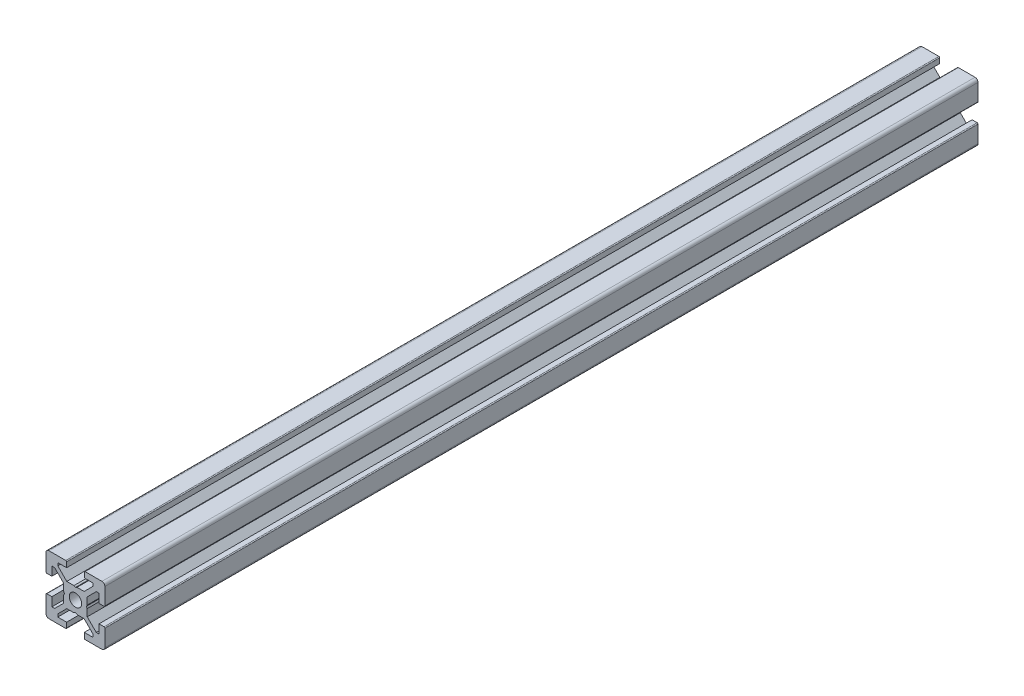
ISO-10303-21;
HEADER;
FILE_DESCRIPTION(('STEP AP214'),'2;1');
FILE_NAME('part.step','',(''),(''),'','','');
FILE_SCHEMA(('AUTOMOTIVE_DESIGN { 1 0 10303 214 1 1 1 1 }'));
ENDSEC;
DATA;
#1=APPLICATION_CONTEXT('core data for automotive mechanical design processes');
#2=APPLICATION_PROTOCOL_DEFINITION('international standard','automotive_design',2000,#1);
#3=PRODUCT_CONTEXT('',#1,'mechanical');
#4=PRODUCT('Part','Part','',(#3));
#5=PRODUCT_RELATED_PRODUCT_CATEGORY('part','',(#4));
#6=PRODUCT_DEFINITION_FORMATION('','',#4);
#7=PRODUCT_DEFINITION_CONTEXT('part definition',#1,'design');
#8=PRODUCT_DEFINITION('design','',#6,#7);
#9=PRODUCT_DEFINITION_SHAPE('','',#8);
#10=(LENGTH_UNIT() NAMED_UNIT(*) SI_UNIT(.MILLI.,.METRE.));
#11=(NAMED_UNIT(*) PLANE_ANGLE_UNIT() SI_UNIT($,.RADIAN.));
#12=(NAMED_UNIT(*) SI_UNIT($,.STERADIAN.) SOLID_ANGLE_UNIT());
#13=UNCERTAINTY_MEASURE_WITH_UNIT(LENGTH_MEASURE(1.E-05),#10,'distance_accuracy_value','');
#14=(GEOMETRIC_REPRESENTATION_CONTEXT(3) GLOBAL_UNCERTAINTY_ASSIGNED_CONTEXT((#13)) GLOBAL_UNIT_ASSIGNED_CONTEXT((#10,
#11,#12)) REPRESENTATION_CONTEXT('',''));
#15=CARTESIAN_POINT('',(0.,0.,0.));
#16=DIRECTION('',(0.,0.,1.));
#17=DIRECTION('',(1.,0.,0.));
#18=AXIS2_PLACEMENT_3D('',#15,#16,#17);
#19=CARTESIAN_POINT('',(-8.99999999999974,8.99999999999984,-296.5));
#20=DIRECTION('',(0.,0.,1.));
#21=DIRECTION('',(1.,0.,0.));
#22=AXIS2_PLACEMENT_3D('',#19,#20,#21);
#23=PLANE('',#22);
#24=CARTESIAN_POINT('',(-8.99999999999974,8.99999999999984,-296.5));
#25=DIRECTION('',(0.,0.,1.));
#26=DIRECTION('',(1.,0.,0.));
#27=AXIS2_PLACEMENT_3D('',#24,#25,#26);
#28=CIRCLE('',#27,1.00000000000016);
#29=CARTESIAN_POINT('',(-8.9999999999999,10.,-296.5));
#30=VERTEX_POINT('',#29);
#31=CARTESIAN_POINT('',(-9.9999999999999,8.9999999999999,-296.5));
#32=VERTEX_POINT('',#31);
#33=EDGE_CURVE('E694',#30,#32,#28,.T.);
#34=ORIENTED_EDGE('',*,*,#33,.F.);
#35=DIRECTION('',(-1.,0.,0.));
#36=VECTOR('',#35,1.);
#37=CARTESIAN_POINT('',(-3.2999999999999,9.9999999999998,-296.5));
#38=LINE('',#37,#36);
#39=CARTESIAN_POINT('',(-3.2999999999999,9.9999999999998,-296.5));
#40=VERTEX_POINT('',#39);
#41=EDGE_CURVE('E483',#40,#30,#38,.T.);
#42=ORIENTED_EDGE('',*,*,#41,.F.);
#43=CARTESIAN_POINT('',(-3.29999999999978,9.69999999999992,-296.5));
#44=DIRECTION('',(0.,0.,1.));
#45=DIRECTION('',(1.,0.,0.));
#46=AXIS2_PLACEMENT_3D('',#43,#44,#45);
#47=CIRCLE('',#46,0.29999999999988);
#48=CARTESIAN_POINT('',(-2.9999999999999,9.6999999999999,-296.5));
#49=VERTEX_POINT('',#48);
#50=EDGE_CURVE('E468',#49,#40,#47,.T.);
#51=ORIENTED_EDGE('',*,*,#50,.F.);
#52=DIRECTION('',(0.,1.,0.));
#53=VECTOR('',#52,1.);
#54=CARTESIAN_POINT('',(-2.9999999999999,8.0000000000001,-296.5));
#55=LINE('',#54,#53);
#56=CARTESIAN_POINT('',(-2.9999999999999,8.0000000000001,-296.5));
#57=VERTEX_POINT('',#56);
#58=EDGE_CURVE('E481',#57,#49,#55,.T.);
#59=ORIENTED_EDGE('',*,*,#58,.F.);
#60=DIRECTION('',(1.,0.,0.));
#61=VECTOR('',#60,1.);
#62=CARTESIAN_POINT('',(-5.9999999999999,7.9999999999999,-296.5));
#63=LINE('',#62,#61);
#64=CARTESIAN_POINT('',(-5.9999999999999,7.9999999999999,-296.5));
#65=VERTEX_POINT('',#64);
#66=EDGE_CURVE('E486',#65,#57,#63,.T.);
#67=ORIENTED_EDGE('',*,*,#66,.F.);
#68=DIRECTION('',(0.,1.,0.));
#69=VECTOR('',#68,1.);
#70=CARTESIAN_POINT('',(-5.9999999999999,7.0606434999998,-296.5));
#71=LINE('',#70,#69);
#72=CARTESIAN_POINT('',(-5.9999999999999,7.0606434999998,-296.5));
#73=VERTEX_POINT('',#72);
#74=EDGE_CURVE('E488',#73,#65,#71,.T.);
#75=ORIENTED_EDGE('',*,*,#74,.F.);
#76=DIRECTION('',(-0.707106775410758,0.707106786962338,0.));
#77=VECTOR('',#76,1.);
#78=CARTESIAN_POINT('',(-2.9393565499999,3.9999999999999,-296.5));
#79=LINE('',#78,#77);
#80=CARTESIAN_POINT('',(-2.9393565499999,3.9999999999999,-296.5));
#81=VERTEX_POINT('',#80);
#82=EDGE_CURVE('E1041',#81,#73,#79,.T.);
#83=ORIENTED_EDGE('',*,*,#82,.F.);
#84=DIRECTION('',(-1.,0.,0.));
#85=VECTOR('',#84,1.);
#86=CARTESIAN_POINT('',(-0.5196281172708,4.0000000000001,-296.5));
#87=LINE('',#86,#85);
#88=CARTESIAN_POINT('',(-0.5196281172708,4.0000000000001,-296.5));
#89=VERTEX_POINT('',#88);
#90=EDGE_CURVE('E1038',#89,#81,#87,.T.);
#91=ORIENTED_EDGE('',*,*,#90,.F.);
#92=DIRECTION('',(-0.866025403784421,0.500000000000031,0.));
#93=VECTOR('',#92,1.);
#94=CARTESIAN_POINT('',(-6.4374999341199E-06,3.6999962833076,-296.5));
#95=LINE('',#94,#93);
#96=CARTESIAN_POINT('',(-6.4374999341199E-06,3.6999962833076,-296.5));
#97=VERTEX_POINT('',#96);
#98=EDGE_CURVE('E1035',#97,#89,#95,.T.);
#99=ORIENTED_EDGE('',*,*,#98,.F.);
#100=DIRECTION('',(-0.866025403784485,-0.49999999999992,0.));
#101=VECTOR('',#100,1.);
#102=CARTESIAN_POINT('',(0.51961524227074,3.9999999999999,-296.5));
#103=LINE('',#102,#101);
#104=CARTESIAN_POINT('',(0.51961524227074,3.9999999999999,-296.5));
#105=VERTEX_POINT('',#104);
#106=EDGE_CURVE('E1032',#105,#97,#103,.T.);
#107=ORIENTED_EDGE('',*,*,#106,.F.);
#108=DIRECTION('',(-1.,0.,0.));
#109=VECTOR('',#108,1.);
#110=CARTESIAN_POINT('',(2.9393308,3.9999999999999,-296.5));
#111=LINE('',#110,#109);
#112=CARTESIAN_POINT('',(2.9393308,3.9999999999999,-296.5));
#113=VERTEX_POINT('',#112);
#114=EDGE_CURVE('E1029',#113,#105,#111,.T.);
#115=ORIENTED_EDGE('',*,*,#114,.F.);
#116=DIRECTION('',(-0.707106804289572,-0.707106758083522,0.));
#117=VECTOR('',#116,1.);
#118=CARTESIAN_POINT('',(6.,7.0606689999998,-296.5));
#119=LINE('',#118,#117);
#120=CARTESIAN_POINT('',(6.,7.0606689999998,-296.5));
#121=VERTEX_POINT('',#120);
#122=EDGE_CURVE('E1026',#121,#113,#119,.T.);
#123=ORIENTED_EDGE('',*,*,#122,.F.);
#124=DIRECTION('',(0.,-1.,0.));
#125=VECTOR('',#124,1.);
#126=CARTESIAN_POINT('',(6.,7.9999999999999,-296.5));
#127=LINE('',#126,#125);
#128=CARTESIAN_POINT('',(6.,7.9999999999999,-296.5));
#129=VERTEX_POINT('',#128);
#130=EDGE_CURVE('E1023',#129,#121,#127,.T.);
#131=ORIENTED_EDGE('',*,*,#130,.F.);
#132=DIRECTION('',(1.,0.,0.));
#133=VECTOR('',#132,1.);
#134=CARTESIAN_POINT('',(3.0000000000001,7.9999999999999,-296.5));
#135=LINE('',#134,#133);
#136=CARTESIAN_POINT('',(3.0000000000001,7.9999999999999,-296.5));
#137=VERTEX_POINT('',#136);
#138=EDGE_CURVE('E1020',#137,#129,#135,.T.);
#139=ORIENTED_EDGE('',*,*,#138,.F.);
#140=DIRECTION('',(0.,-1.,0.));
#141=VECTOR('',#140,1.);
#142=CARTESIAN_POINT('',(3.0000000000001,9.7000000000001,-296.5));
#143=LINE('',#142,#141);
#144=CARTESIAN_POINT('',(3.0000000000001,9.7000000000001,-296.5));
#145=VERTEX_POINT('',#144);
#146=EDGE_CURVE('E1017',#145,#137,#143,.T.);
#147=ORIENTED_EDGE('',*,*,#146,.F.);
#148=CARTESIAN_POINT('',(3.29999989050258,9.70000010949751,-296.5));
#149=DIRECTION('',(0.,0.,1.));
#150=DIRECTION('',(1.,0.,0.));
#151=AXIS2_PLACEMENT_3D('',#148,#149,#150);
#152=CIRCLE('',#151,0.299999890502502);
#153=CARTESIAN_POINT('',(3.2999999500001,10.,-296.5));
#154=VERTEX_POINT('',#153);
#155=EDGE_CURVE('E1014',#154,#145,#152,.T.);
#156=ORIENTED_EDGE('',*,*,#155,.F.);
#157=DIRECTION('',(-1.,0.,0.));
#158=VECTOR('',#157,1.);
#159=CARTESIAN_POINT('',(9.,10.,-296.5));
#160=LINE('',#159,#158);
#161=CARTESIAN_POINT('',(9.,10.,-296.5));
#162=VERTEX_POINT('',#161);
#163=EDGE_CURVE('E1011',#162,#154,#160,.T.);
#164=ORIENTED_EDGE('',*,*,#163,.F.);
#165=CARTESIAN_POINT('',(8.99999999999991,9.00000000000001,-296.5));
#166=DIRECTION('',(0.,0.,1.));
#167=DIRECTION('',(1.,0.,0.));
#168=AXIS2_PLACEMENT_3D('',#165,#166,#167);
#169=CIRCLE('',#168,0.999999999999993);
#170=CARTESIAN_POINT('',(9.9999999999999,8.9999999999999,-296.5));
#171=VERTEX_POINT('',#170);
#172=EDGE_CURVE('E1008',#171,#162,#169,.T.);
#173=ORIENTED_EDGE('',*,*,#172,.F.);
#174=DIRECTION('',(0.,1.,0.));
#175=VECTOR('',#174,1.);
#176=CARTESIAN_POINT('',(9.9999999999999,3.2999999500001,-296.5));
#177=LINE('',#176,#175);
#178=CARTESIAN_POINT('',(9.9999999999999,3.2999999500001,-296.5));
#179=VERTEX_POINT('',#178);
#180=EDGE_CURVE('E1005',#179,#171,#177,.T.);
#181=ORIENTED_EDGE('',*,*,#180,.F.);
#182=CARTESIAN_POINT('',(9.70000010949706,3.29999989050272,-296.5));
#183=DIRECTION('',(0.,0.,1.));
#184=DIRECTION('',(1.,0.,0.));
#185=AXIS2_PLACEMENT_3D('',#182,#183,#184);
#186=CIRCLE('',#185,0.299999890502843);
#187=CARTESIAN_POINT('',(9.6999999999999,2.9999999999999,-296.5));
#188=VERTEX_POINT('',#187);
#189=EDGE_CURVE('E1002',#188,#179,#186,.T.);
#190=ORIENTED_EDGE('',*,*,#189,.F.);
#191=DIRECTION('',(1.,0.,0.));
#192=VECTOR('',#191,1.);
#193=CARTESIAN_POINT('',(8.,2.9999999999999,-296.5));
#194=LINE('',#193,#192);
#195=CARTESIAN_POINT('',(8.,2.9999999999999,-296.5));
#196=VERTEX_POINT('',#195);
#197=EDGE_CURVE('E999',#196,#188,#194,.T.);
#198=ORIENTED_EDGE('',*,*,#197,.F.);
#199=DIRECTION('',(0.,-1.,0.));
#200=VECTOR('',#199,1.);
#201=CARTESIAN_POINT('',(8.,5.9999999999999,-296.5));
#202=LINE('',#201,#200);
#203=CARTESIAN_POINT('',(8.,5.9999999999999,-296.5));
#204=VERTEX_POINT('',#203);
#205=EDGE_CURVE('E996',#204,#196,#202,.T.);
#206=ORIENTED_EDGE('',*,*,#205,.F.);
#207=DIRECTION('',(1.,0.,0.));
#208=VECTOR('',#207,1.);
#209=CARTESIAN_POINT('',(7.0606510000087,5.9999999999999,-296.5));
#210=LINE('',#209,#208);
#211=CARTESIAN_POINT('',(7.0606510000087,5.9999999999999,-296.5));
#212=VERTEX_POINT('',#211);
#213=EDGE_CURVE('E993',#212,#204,#210,.T.);
#214=ORIENTED_EDGE('',*,*,#213,.F.);
#215=DIRECTION('',(0.70710575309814,0.70710780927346,0.));
#216=VECTOR('',#215,1.);
#217=CARTESIAN_POINT('',(4.0000000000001,2.9393401,-296.5));
#218=LINE('',#217,#216);
#219=CARTESIAN_POINT('',(4.0000000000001,2.9393401,-296.5));
#220=VERTEX_POINT('',#219);
#221=EDGE_CURVE('E990',#220,#212,#218,.T.);
#222=ORIENTED_EDGE('',*,*,#221,.F.);
#223=DIRECTION('',(0.,1.,0.));
#224=VECTOR('',#223,1.);
#225=CARTESIAN_POINT('',(4.0000000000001,0.51962811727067,-296.5));
#226=LINE('',#225,#224);
#227=CARTESIAN_POINT('',(4.0000000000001,0.51962811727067,-296.5));
#228=VERTEX_POINT('',#227);
#229=EDGE_CURVE('E987',#228,#220,#226,.T.);
#230=ORIENTED_EDGE('',*,*,#229,.F.);
#231=DIRECTION('',(0.50000000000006,0.866025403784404,0.));
#232=VECTOR('',#231,1.);
#233=CARTESIAN_POINT('',(3.6999962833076,6.43749984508E-06,-296.5));
#234=LINE('',#233,#232);
#235=CARTESIAN_POINT('',(3.6999962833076,6.43749984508E-06,-296.5));
#236=VERTEX_POINT('',#235);
#237=EDGE_CURVE('E984',#236,#228,#234,.T.);
#238=ORIENTED_EDGE('',*,*,#237,.F.);
#239=DIRECTION('',(-0.500000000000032,0.86602540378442,0.));
#240=VECTOR('',#239,1.);
#241=CARTESIAN_POINT('',(4.0000000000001,-0.51961524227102,-296.5));
#242=LINE('',#241,#240);
#243=CARTESIAN_POINT('',(4.0000000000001,-0.51961524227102,-296.5));
#244=VERTEX_POINT('',#243);
#245=EDGE_CURVE('E981',#244,#236,#242,.T.);
#246=ORIENTED_EDGE('',*,*,#245,.F.);
#247=DIRECTION('',(0.,1.,0.));
#248=VECTOR('',#247,1.);
#249=CARTESIAN_POINT('',(4.0000000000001,-2.9393482,-296.5));
#250=LINE('',#249,#248);
#251=CARTESIAN_POINT('',(4.0000000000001,-2.9393482,-296.5));
#252=VERTEX_POINT('',#251);
#253=EDGE_CURVE('E978',#252,#244,#250,.T.);
#254=ORIENTED_EDGE('',*,*,#253,.F.);
#255=DIRECTION('',(-0.707105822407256,0.707107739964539,0.));
#256=VECTOR('',#255,1.);
#257=CARTESIAN_POINT('',(7.060643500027,-5.9999999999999,-296.5));
#258=LINE('',#257,#256);
#259=CARTESIAN_POINT('',(7.060643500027,-5.9999999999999,-296.5));
#260=VERTEX_POINT('',#259);
#261=EDGE_CURVE('E975',#260,#252,#258,.T.);
#262=ORIENTED_EDGE('',*,*,#261,.F.);
#263=DIRECTION('',(-1.,0.,0.));
#264=VECTOR('',#263,1.);
#265=CARTESIAN_POINT('',(8.,-5.9999999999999,-296.5));
#266=LINE('',#265,#264);
#267=CARTESIAN_POINT('',(8.,-5.9999999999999,-296.5));
#268=VERTEX_POINT('',#267);
#269=EDGE_CURVE('E972',#268,#260,#266,.T.);
#270=ORIENTED_EDGE('',*,*,#269,.F.);
#271=DIRECTION('',(0.,-1.,0.));
#272=VECTOR('',#271,1.);
#273=CARTESIAN_POINT('',(8.,-2.9999999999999,-296.5));
#274=LINE('',#273,#272);
#275=CARTESIAN_POINT('',(8.,-2.9999999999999,-296.5));
#276=VERTEX_POINT('',#275);
#277=EDGE_CURVE('E969',#276,#268,#274,.T.);
#278=ORIENTED_EDGE('',*,*,#277,.F.);
#279=DIRECTION('',(-1.,0.,0.));
#280=VECTOR('',#279,1.);
#281=CARTESIAN_POINT('',(9.6999999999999,-2.9999999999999,-296.5));
#282=LINE('',#281,#280);
#283=CARTESIAN_POINT('',(9.6999999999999,-2.9999999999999,-296.5));
#284=VERTEX_POINT('',#283);
#285=EDGE_CURVE('E966',#284,#276,#282,.T.);
#286=ORIENTED_EDGE('',*,*,#285,.F.);
#287=CARTESIAN_POINT('',(9.70000010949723,-3.29999989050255,-296.5));
#288=DIRECTION('',(0.,0.,1.));
#289=DIRECTION('',(1.,0.,0.));
#290=AXIS2_PLACEMENT_3D('',#287,#288,#289);
#291=CIRCLE('',#290,0.299999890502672);
#292=CARTESIAN_POINT('',(9.9999999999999,-3.29999995,-296.5));
#293=VERTEX_POINT('',#292);
#294=EDGE_CURVE('E963',#293,#284,#291,.T.);
#295=ORIENTED_EDGE('',*,*,#294,.F.);
#296=DIRECTION('',(0.,1.,0.));
#297=VECTOR('',#296,1.);
#298=CARTESIAN_POINT('',(9.9999999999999,-8.9999999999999,-296.5));
#299=LINE('',#298,#297);
#300=CARTESIAN_POINT('',(9.9999999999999,-8.9999999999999,-296.5));
#301=VERTEX_POINT('',#300);
#302=EDGE_CURVE('E960',#301,#293,#299,.T.);
#303=ORIENTED_EDGE('',*,*,#302,.F.);
#304=CARTESIAN_POINT('',(8.99999999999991,-9.00000000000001,-296.5));
#305=DIRECTION('',(0.,0.,1.));
#306=DIRECTION('',(1.,0.,0.));
#307=AXIS2_PLACEMENT_3D('',#304,#305,#306);
#308=CIRCLE('',#307,0.999999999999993);
#309=CARTESIAN_POINT('',(9.,-10.,-296.5));
#310=VERTEX_POINT('',#309);
#311=EDGE_CURVE('E957',#310,#301,#308,.T.);
#312=ORIENTED_EDGE('',*,*,#311,.F.);
#313=DIRECTION('',(1.,0.,0.));
#314=VECTOR('',#313,1.);
#315=CARTESIAN_POINT('',(3.2999999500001,-10.,-296.5));
#316=LINE('',#315,#314);
#317=CARTESIAN_POINT('',(3.2999999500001,-10.,-296.5));
#318=VERTEX_POINT('',#317);
#319=EDGE_CURVE('E954',#318,#310,#316,.T.);
#320=ORIENTED_EDGE('',*,*,#319,.F.);
#321=CARTESIAN_POINT('',(3.29999989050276,-9.70000010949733,-296.5));
#322=DIRECTION('',(0.,0.,1.));
#323=DIRECTION('',(1.,0.,0.));
#324=AXIS2_PLACEMENT_3D('',#321,#322,#323);
#325=CIRCLE('',#324,0.299999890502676);
#326=CARTESIAN_POINT('',(3.0000000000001,-9.7,-296.5));
#327=VERTEX_POINT('',#326);
#328=EDGE_CURVE('E951',#327,#318,#325,.T.);
#329=ORIENTED_EDGE('',*,*,#328,.F.);
#330=DIRECTION('',(0.,-1.,0.));
#331=VECTOR('',#330,1.);
#332=CARTESIAN_POINT('',(3.0000000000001,-8.,-296.5));
#333=LINE('',#332,#331);
#334=CARTESIAN_POINT('',(3.0000000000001,-8.,-296.5));
#335=VERTEX_POINT('',#334);
#336=EDGE_CURVE('E948',#335,#327,#333,.T.);
#337=ORIENTED_EDGE('',*,*,#336,.F.);
#338=DIRECTION('',(-1.,0.,0.));
#339=VECTOR('',#338,1.);
#340=CARTESIAN_POINT('',(6.,-8.,-296.5));
#341=LINE('',#340,#339);
#342=CARTESIAN_POINT('',(6.,-8.,-296.5));
#343=VERTEX_POINT('',#342);
#344=EDGE_CURVE('E945',#343,#335,#341,.T.);
#345=ORIENTED_EDGE('',*,*,#344,.F.);
#346=DIRECTION('',(0.,-1.,0.));
#347=VECTOR('',#346,1.);
#348=CARTESIAN_POINT('',(6.,-7.0606769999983,-296.5));
#349=LINE('',#348,#347);
#350=CARTESIAN_POINT('',(6.,-7.0606769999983,-296.5));
#351=VERTEX_POINT('',#350);
#352=EDGE_CURVE('E942',#351,#343,#349,.T.);
#353=ORIENTED_EDGE('',*,*,#352,.F.);
#354=DIRECTION('',(0.707106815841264,-0.707106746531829,0.));
#355=VECTOR('',#354,1.);
#356=CARTESIAN_POINT('',(2.9393226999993,-4.0000000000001,-296.5));
#357=LINE('',#356,#355);
#358=CARTESIAN_POINT('',(2.9393226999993,-4.0000000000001,-296.5));
#359=VERTEX_POINT('',#358);
#360=EDGE_CURVE('E939',#359,#351,#357,.T.);
#361=ORIENTED_EDGE('',*,*,#360,.F.);
#362=DIRECTION('',(1.,0.,0.));
#363=VECTOR('',#362,1.);
#364=CARTESIAN_POINT('',(0.51962811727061,-4.0000000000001,-296.5));
#365=LINE('',#364,#363);
#366=CARTESIAN_POINT('',(0.51962811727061,-4.0000000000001,-296.5));
#367=VERTEX_POINT('',#366);
#368=EDGE_CURVE('E936',#367,#359,#365,.T.);
#369=ORIENTED_EDGE('',*,*,#368,.F.);
#370=DIRECTION('',(0.866025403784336,-0.500000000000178,0.));
#371=VECTOR('',#370,1.);
#372=CARTESIAN_POINT('',(6.4374999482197E-06,-3.6999962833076,-296.5));
#373=LINE('',#372,#371);
#374=CARTESIAN_POINT('',(6.4374999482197E-06,-3.6999962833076,-296.5));
#375=VERTEX_POINT('',#374);
#376=EDGE_CURVE('E933',#375,#367,#373,.T.);
#377=ORIENTED_EDGE('',*,*,#376,.F.);
#378=DIRECTION('',(0.866025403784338,0.500000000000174,0.));
#379=VECTOR('',#378,1.);
#380=CARTESIAN_POINT('',(-0.51961524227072,-4.0000000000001,-296.5));
#381=LINE('',#380,#379);
#382=CARTESIAN_POINT('',(-0.51961524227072,-4.0000000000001,-296.5));
#383=VERTEX_POINT('',#382);
#384=EDGE_CURVE('E930',#383,#375,#381,.T.);
#385=ORIENTED_EDGE('',*,*,#384,.F.);
#386=DIRECTION('',(1.,0.,0.));
#387=VECTOR('',#386,1.);
#388=CARTESIAN_POINT('',(-2.9393488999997,-4.0000000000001,-296.5));
#389=LINE('',#388,#387);
#390=CARTESIAN_POINT('',(-2.9393488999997,-4.0000000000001,-296.5));
#391=VERTEX_POINT('',#390);
#392=EDGE_CURVE('E927',#391,#383,#389,.T.);
#393=ORIENTED_EDGE('',*,*,#392,.F.);
#394=DIRECTION('',(0.707106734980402,0.707106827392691,0.));
#395=VECTOR('',#394,1.);
#396=CARTESIAN_POINT('',(-5.9999999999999,-7.060651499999,-296.5));
#397=LINE('',#396,#395);
#398=CARTESIAN_POINT('',(-5.9999999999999,-7.060651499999,-296.5));
#399=VERTEX_POINT('',#398);
#400=EDGE_CURVE('E924',#399,#391,#397,.T.);
#401=ORIENTED_EDGE('',*,*,#400,.F.);
#402=DIRECTION('',(0.,1.,0.));
#403=VECTOR('',#402,1.);
#404=CARTESIAN_POINT('',(-5.9999999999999,-8.,-296.5));
#405=LINE('',#404,#403);
#406=CARTESIAN_POINT('',(-5.9999999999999,-8.,-296.5));
#407=VERTEX_POINT('',#406);
#408=EDGE_CURVE('E921',#407,#399,#405,.T.);
#409=ORIENTED_EDGE('',*,*,#408,.F.);
#410=DIRECTION('',(-1.,0.,0.));
#411=VECTOR('',#410,1.);
#412=CARTESIAN_POINT('',(-2.9999999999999,-8.,-296.5));
#413=LINE('',#412,#411);
#414=CARTESIAN_POINT('',(-2.9999999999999,-8.,-296.5));
#415=VERTEX_POINT('',#414);
#416=EDGE_CURVE('E918',#415,#407,#413,.T.);
#417=ORIENTED_EDGE('',*,*,#416,.F.);
#418=DIRECTION('',(0.,1.,0.));
#419=VECTOR('',#418,1.);
#420=CARTESIAN_POINT('',(-2.9999999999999,-9.7,-296.5));
#421=LINE('',#420,#419);
#422=CARTESIAN_POINT('',(-2.9999999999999,-9.7,-296.5));
#423=VERTEX_POINT('',#422);
#424=EDGE_CURVE('E915',#423,#415,#421,.T.);
#425=ORIENTED_EDGE('',*,*,#424,.F.);
#426=CARTESIAN_POINT('',(-3.29999989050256,-9.70000010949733,-296.5));
#427=DIRECTION('',(0.,0.,1.));
#428=DIRECTION('',(1.,0.,0.));
#429=AXIS2_PLACEMENT_3D('',#426,#427,#428);
#430=CIRCLE('',#429,0.299999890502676);
#431=CARTESIAN_POINT('',(-3.2999999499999,-10.,-296.5));
#432=VERTEX_POINT('',#431);
#433=EDGE_CURVE('E912',#432,#423,#430,.T.);
#434=ORIENTED_EDGE('',*,*,#433,.F.);
#435=DIRECTION('',(1.,0.,0.));
#436=VECTOR('',#435,1.);
#437=CARTESIAN_POINT('',(-8.9999999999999,-10.,-296.5));
#438=LINE('',#437,#436);
#439=CARTESIAN_POINT('',(-8.9999999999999,-10.,-296.5));
#440=VERTEX_POINT('',#439);
#441=EDGE_CURVE('E909',#440,#432,#438,.T.);
#442=ORIENTED_EDGE('',*,*,#441,.F.);
#443=CARTESIAN_POINT('',(-8.99999999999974,-8.99999999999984,-296.5));
#444=DIRECTION('',(0.,0.,1.));
#445=DIRECTION('',(1.,0.,0.));
#446=AXIS2_PLACEMENT_3D('',#443,#444,#445);
#447=CIRCLE('',#446,1.00000000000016);
#448=CARTESIAN_POINT('',(-9.9999999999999,-8.9999999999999,-296.5));
#449=VERTEX_POINT('',#448);
#450=EDGE_CURVE('E906',#449,#440,#447,.T.);
#451=ORIENTED_EDGE('',*,*,#450,.F.);
#452=DIRECTION('',(0.,-1.,0.));
#453=VECTOR('',#452,1.);
#454=CARTESIAN_POINT('',(-9.9999999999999,-3.29999995,-296.5));
#455=LINE('',#454,#453);
#456=CARTESIAN_POINT('',(-9.9999999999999,-3.29999995,-296.5));
#457=VERTEX_POINT('',#456);
#458=EDGE_CURVE('E903',#457,#449,#455,.T.);
#459=ORIENTED_EDGE('',*,*,#458,.F.);
#460=CARTESIAN_POINT('',(-9.70000010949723,-3.29999989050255,-296.5));
#461=DIRECTION('',(0.,0.,1.));
#462=DIRECTION('',(1.,0.,0.));
#463=AXIS2_PLACEMENT_3D('',#460,#461,#462);
#464=CIRCLE('',#463,0.299999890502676);
#465=CARTESIAN_POINT('',(-9.6999999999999,-2.9999999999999,-296.5));
#466=VERTEX_POINT('',#465);
#467=EDGE_CURVE('E900',#466,#457,#464,.T.);
#468=ORIENTED_EDGE('',*,*,#467,.F.);
#469=DIRECTION('',(-1.,0.,0.));
#470=VECTOR('',#469,1.);
#471=CARTESIAN_POINT('',(-7.9999999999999,-2.9999999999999,-296.5));
#472=LINE('',#471,#470);
#473=CARTESIAN_POINT('',(-7.9999999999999,-2.9999999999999,-296.5));
#474=VERTEX_POINT('',#473);
#475=EDGE_CURVE('E897',#474,#466,#472,.T.);
#476=ORIENTED_EDGE('',*,*,#475,.F.);
#477=DIRECTION('',(0.,1.,0.));
#478=VECTOR('',#477,1.);
#479=CARTESIAN_POINT('',(-7.9999999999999,-5.9999999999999,-296.5));
#480=LINE('',#479,#478);
#481=CARTESIAN_POINT('',(-7.9999999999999,-5.9999999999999,-296.5));
#482=VERTEX_POINT('',#481);
#483=EDGE_CURVE('E894',#482,#474,#480,.T.);
#484=ORIENTED_EDGE('',*,*,#483,.F.);
#485=DIRECTION('',(-1.,0.,0.));
#486=VECTOR('',#485,1.);
#487=CARTESIAN_POINT('',(-7.0606695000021,-5.9999999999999,-296.5));
#488=LINE('',#487,#486);
#489=CARTESIAN_POINT('',(-7.0606695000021,-5.9999999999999,-296.5));
#490=VERTEX_POINT('',#489);
#491=EDGE_CURVE('E891',#490,#482,#488,.T.);
#492=ORIENTED_EDGE('',*,*,#491,.F.);
#493=DIRECTION('',(-0.70710756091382,-0.707106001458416,0.));
#494=VECTOR('',#493,1.);
#495=CARTESIAN_POINT('',(-3.9999999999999,-2.9393372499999,-296.5));
#496=LINE('',#495,#494);
#497=CARTESIAN_POINT('',(-3.9999999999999,-2.9393372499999,-296.5));
#498=VERTEX_POINT('',#497);
#499=EDGE_CURVE('E888',#498,#490,#496,.T.);
#500=ORIENTED_EDGE('',*,*,#499,.F.);
#501=DIRECTION('',(0.,-1.,0.));
#502=VECTOR('',#501,1.);
#503=CARTESIAN_POINT('',(-3.9999999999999,-0.51962811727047,-296.5));
#504=LINE('',#503,#502);
#505=CARTESIAN_POINT('',(-3.9999999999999,-0.51962811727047,-296.5));
#506=VERTEX_POINT('',#505);
#507=EDGE_CURVE('E885',#506,#498,#504,.T.);
#508=ORIENTED_EDGE('',*,*,#507,.F.);
#509=DIRECTION('',(-0.50000000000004,-0.866025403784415,0.));
#510=VECTOR('',#509,1.);
#511=CARTESIAN_POINT('',(-3.6999962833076,-6.4374999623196E-06,-296.5));
#512=LINE('',#511,#510);
#513=CARTESIAN_POINT('',(-3.6999962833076,-6.4374999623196E-06,-296.5));
#514=VERTEX_POINT('',#513);
#515=EDGE_CURVE('E882',#514,#506,#512,.T.);
#516=ORIENTED_EDGE('',*,*,#515,.F.);
#517=DIRECTION('',(0.500000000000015,-0.86602540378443,0.));
#518=VECTOR('',#517,1.);
#519=CARTESIAN_POINT('',(-3.9999999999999,0.51961524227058,-296.5));
#520=LINE('',#519,#518);
#521=CARTESIAN_POINT('',(-3.9999999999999,0.51961524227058,-296.5));
#522=VERTEX_POINT('',#521);
#523=EDGE_CURVE('E879',#522,#514,#520,.T.);
#524=ORIENTED_EDGE('',*,*,#523,.F.);
#525=DIRECTION('',(0.,-1.,0.));
#526=VECTOR('',#525,1.);
#527=CARTESIAN_POINT('',(-3.9999999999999,2.9393296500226,-296.5));
#528=LINE('',#527,#526);
#529=CARTESIAN_POINT('',(-3.9999999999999,2.9393296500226,-296.5));
#530=VERTEX_POINT('',#529);
#531=EDGE_CURVE('E876',#530,#522,#528,.T.);
#532=ORIENTED_EDGE('',*,*,#531,.F.);
#533=DIRECTION('',(0.707107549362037,-0.707106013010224,0.));
#534=VECTOR('',#533,1.);
#535=CARTESIAN_POINT('',(-7.0606769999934,5.9999999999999,-296.5));
#536=LINE('',#535,#534);
#537=CARTESIAN_POINT('',(-7.0606769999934,5.9999999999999,-296.5));
#538=VERTEX_POINT('',#537);
#539=EDGE_CURVE('E873',#538,#530,#536,.T.);
#540=ORIENTED_EDGE('',*,*,#539,.F.);
#541=DIRECTION('',(1.,0.,0.));
#542=VECTOR('',#541,1.);
#543=CARTESIAN_POINT('',(-7.9999999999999,5.9999999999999,-296.5));
#544=LINE('',#543,#542);
#545=CARTESIAN_POINT('',(-7.9999999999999,5.9999999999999,-296.5));
#546=VERTEX_POINT('',#545);
#547=EDGE_CURVE('E870',#546,#538,#544,.T.);
#548=ORIENTED_EDGE('',*,*,#547,.F.);
#549=DIRECTION('',(0.,1.,0.));
#550=VECTOR('',#549,1.);
#551=CARTESIAN_POINT('',(-7.9999999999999,2.9999999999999,-296.5));
#552=LINE('',#551,#550);
#553=CARTESIAN_POINT('',(-7.9999999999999,2.9999999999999,-296.5));
#554=VERTEX_POINT('',#553);
#555=EDGE_CURVE('E867',#554,#546,#552,.T.);
#556=ORIENTED_EDGE('',*,*,#555,.F.);
#557=DIRECTION('',(1.,0.,0.));
#558=VECTOR('',#557,1.);
#559=CARTESIAN_POINT('',(-9.6999999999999,2.9999999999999,-296.5));
#560=LINE('',#559,#558);
#561=CARTESIAN_POINT('',(-9.6999999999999,2.9999999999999,-296.5));
#562=VERTEX_POINT('',#561);
#563=EDGE_CURVE('E864',#562,#554,#560,.T.);
#564=ORIENTED_EDGE('',*,*,#563,.F.);
#565=CARTESIAN_POINT('',(-9.70000010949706,3.29999989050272,-296.5));
#566=DIRECTION('',(0.,0.,1.));
#567=DIRECTION('',(1.,0.,0.));
#568=AXIS2_PLACEMENT_3D('',#565,#566,#567);
#569=CIRCLE('',#568,0.299999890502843);
#570=CARTESIAN_POINT('',(-9.9999999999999,3.2999999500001,-296.5));
#571=VERTEX_POINT('',#570);
#572=EDGE_CURVE('E861',#571,#562,#569,.T.);
#573=ORIENTED_EDGE('',*,*,#572,.F.);
#574=DIRECTION('',(0.,-1.,0.));
#575=VECTOR('',#574,1.);
#576=CARTESIAN_POINT('',(-9.9999999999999,8.9999999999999,-296.5));
#577=LINE('',#576,#575);
#578=EDGE_CURVE('E859',#32,#571,#577,.T.);
#579=ORIENTED_EDGE('',*,*,#578,.F.);
#580=EDGE_LOOP('',(#34,#42,#51,#59,#67,#75,#83,#91,#99,#107,#115,#123,#131,#139,#147,#156,#164,
#173,#181,#190,#198,#206,#214,#222,#230,#238,#246,#254,#262,#270,#278,#286,#295,#303,#312,#320,
#329,#337,#345,#353,#361,#369,#377,#385,#393,#401,#409,#417,#425,#434,#442,#451,#459,#468,#476,
#484,#492,#500,#508,#516,#524,#532,#540,#548,#556,#564,#573,#579));
#581=FACE_BOUND('',#580,.T.);
#582=CARTESIAN_POINT('',(0.,0.,-296.5));
#583=DIRECTION('',(0.,0.,1.));
#584=DIRECTION('',(1.,0.,0.));
#585=AXIS2_PLACEMENT_3D('',#582,#583,#584);
#586=CIRCLE('',#585,2.1);
#587=CARTESIAN_POINT('',(2.1,0.,-296.5));
#588=VERTEX_POINT('',#587);
#589=EDGE_CURVE('E497',#588,#588,#586,.F.);
#590=ORIENTED_EDGE('',*,*,#589,.F.);
#591=EDGE_LOOP('',(#590));
#592=FACE_BOUND('',#591,.T.);
#593=ADVANCED_FACE('F35',(#581,#592),#23,.F.);
#594=CARTESIAN_POINT('',(-8.99999999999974,8.99999999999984,0.));
#595=DIRECTION('',(0.,0.,1.));
#596=DIRECTION('',(1.,0.,0.));
#597=AXIS2_PLACEMENT_3D('',#594,#595,#596);
#598=PLANE('',#597);
#599=CARTESIAN_POINT('',(-8.99999999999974,8.99999999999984,0.));
#600=DIRECTION('',(0.,0.,1.));
#601=DIRECTION('',(1.,0.,0.));
#602=AXIS2_PLACEMENT_3D('',#599,#600,#601);
#603=CIRCLE('',#602,1.00000000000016);
#604=CARTESIAN_POINT('',(-8.9999999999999,10.,0.));
#605=VERTEX_POINT('',#604);
#606=CARTESIAN_POINT('',(-9.9999999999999,8.9999999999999,0.));
#607=VERTEX_POINT('',#606);
#608=EDGE_CURVE('E493',#605,#607,#603,.T.);
#609=ORIENTED_EDGE('',*,*,#608,.T.);
#610=DIRECTION('',(0.,-1.,0.));
#611=VECTOR('',#610,1.);
#612=CARTESIAN_POINT('',(-9.9999999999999,8.9999999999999,0.));
#613=LINE('',#612,#611);
#614=CARTESIAN_POINT('',(-9.9999999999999,3.2999999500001,0.));
#615=VERTEX_POINT('',#614);
#616=EDGE_CURVE('E496',#607,#615,#613,.T.);
#617=ORIENTED_EDGE('',*,*,#616,.T.);
#618=CARTESIAN_POINT('',(-9.70000010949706,3.29999989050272,0.));
#619=DIRECTION('',(0.,0.,1.));
#620=DIRECTION('',(1.,0.,0.));
#621=AXIS2_PLACEMENT_3D('',#618,#619,#620);
#622=CIRCLE('',#621,0.299999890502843);
#623=CARTESIAN_POINT('',(-9.6999999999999,2.9999999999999,0.));
#624=VERTEX_POINT('',#623);
#625=EDGE_CURVE('E500',#615,#624,#622,.T.);
#626=ORIENTED_EDGE('',*,*,#625,.T.);
#627=DIRECTION('',(1.,0.,0.));
#628=VECTOR('',#627,1.);
#629=CARTESIAN_POINT('',(-9.6999999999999,2.9999999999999,0.));
#630=LINE('',#629,#628);
#631=CARTESIAN_POINT('',(-7.9999999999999,2.9999999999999,0.));
#632=VERTEX_POINT('',#631);
#633=EDGE_CURVE('E503',#624,#632,#630,.T.);
#634=ORIENTED_EDGE('',*,*,#633,.T.);
#635=DIRECTION('',(0.,1.,0.));
#636=VECTOR('',#635,1.);
#637=CARTESIAN_POINT('',(-7.9999999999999,2.9999999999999,0.));
#638=LINE('',#637,#636);
#639=CARTESIAN_POINT('',(-7.9999999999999,5.9999999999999,0.));
#640=VERTEX_POINT('',#639);
#641=EDGE_CURVE('E506',#632,#640,#638,.T.);
#642=ORIENTED_EDGE('',*,*,#641,.T.);
#643=DIRECTION('',(1.,0.,0.));
#644=VECTOR('',#643,1.);
#645=CARTESIAN_POINT('',(-7.9999999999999,5.9999999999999,0.));
#646=LINE('',#645,#644);
#647=CARTESIAN_POINT('',(-7.0606769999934,5.9999999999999,0.));
#648=VERTEX_POINT('',#647);
#649=EDGE_CURVE('E509',#640,#648,#646,.T.);
#650=ORIENTED_EDGE('',*,*,#649,.T.);
#651=DIRECTION('',(0.707107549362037,-0.707106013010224,0.));
#652=VECTOR('',#651,1.);
#653=CARTESIAN_POINT('',(-7.0606769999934,5.9999999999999,0.));
#654=LINE('',#653,#652);
#655=CARTESIAN_POINT('',(-3.9999999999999,2.9393296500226,0.));
#656=VERTEX_POINT('',#655);
#657=EDGE_CURVE('E512',#648,#656,#654,.T.);
#658=ORIENTED_EDGE('',*,*,#657,.T.);
#659=DIRECTION('',(0.,-1.,0.));
#660=VECTOR('',#659,1.);
#661=CARTESIAN_POINT('',(-3.9999999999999,2.9393296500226,0.));
#662=LINE('',#661,#660);
#663=CARTESIAN_POINT('',(-3.9999999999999,0.51961524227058,0.));
#664=VERTEX_POINT('',#663);
#665=EDGE_CURVE('E515',#656,#664,#662,.T.);
#666=ORIENTED_EDGE('',*,*,#665,.T.);
#667=DIRECTION('',(0.500000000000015,-0.86602540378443,0.));
#668=VECTOR('',#667,1.);
#669=CARTESIAN_POINT('',(-3.9999999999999,0.51961524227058,0.));
#670=LINE('',#669,#668);
#671=CARTESIAN_POINT('',(-3.6999962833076,-6.4374999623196E-06,0.));
#672=VERTEX_POINT('',#671);
#673=EDGE_CURVE('E518',#664,#672,#670,.T.);
#674=ORIENTED_EDGE('',*,*,#673,.T.);
#675=DIRECTION('',(-0.50000000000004,-0.866025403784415,0.));
#676=VECTOR('',#675,1.);
#677=CARTESIAN_POINT('',(-3.6999962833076,-6.4374999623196E-06,0.));
#678=LINE('',#677,#676);
#679=CARTESIAN_POINT('',(-3.9999999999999,-0.51962811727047,0.));
#680=VERTEX_POINT('',#679);
#681=EDGE_CURVE('E521',#672,#680,#678,.T.);
#682=ORIENTED_EDGE('',*,*,#681,.T.);
#683=DIRECTION('',(0.,-1.,0.));
#684=VECTOR('',#683,1.);
#685=CARTESIAN_POINT('',(-3.9999999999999,-0.51962811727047,0.));
#686=LINE('',#685,#684);
#687=CARTESIAN_POINT('',(-3.9999999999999,-2.9393372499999,0.));
#688=VERTEX_POINT('',#687);
#689=EDGE_CURVE('E524',#680,#688,#686,.T.);
#690=ORIENTED_EDGE('',*,*,#689,.T.);
#691=DIRECTION('',(-0.70710756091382,-0.707106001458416,0.));
#692=VECTOR('',#691,1.);
#693=CARTESIAN_POINT('',(-3.9999999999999,-2.9393372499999,0.));
#694=LINE('',#693,#692);
#695=CARTESIAN_POINT('',(-7.0606695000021,-5.9999999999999,0.));
#696=VERTEX_POINT('',#695);
#697=EDGE_CURVE('E527',#688,#696,#694,.T.);
#698=ORIENTED_EDGE('',*,*,#697,.T.);
#699=DIRECTION('',(-1.,0.,0.));
#700=VECTOR('',#699,1.);
#701=CARTESIAN_POINT('',(-7.0606695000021,-5.9999999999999,0.));
#702=LINE('',#701,#700);
#703=CARTESIAN_POINT('',(-7.9999999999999,-5.9999999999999,0.));
#704=VERTEX_POINT('',#703);
#705=EDGE_CURVE('E530',#696,#704,#702,.T.);
#706=ORIENTED_EDGE('',*,*,#705,.T.);
#707=DIRECTION('',(0.,1.,0.));
#708=VECTOR('',#707,1.);
#709=CARTESIAN_POINT('',(-7.9999999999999,-5.9999999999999,0.));
#710=LINE('',#709,#708);
#711=CARTESIAN_POINT('',(-7.9999999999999,-2.9999999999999,0.));
#712=VERTEX_POINT('',#711);
#713=EDGE_CURVE('E533',#704,#712,#710,.T.);
#714=ORIENTED_EDGE('',*,*,#713,.T.);
#715=DIRECTION('',(-1.,0.,0.));
#716=VECTOR('',#715,1.);
#717=CARTESIAN_POINT('',(-7.9999999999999,-2.9999999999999,0.));
#718=LINE('',#717,#716);
#719=CARTESIAN_POINT('',(-9.6999999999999,-2.9999999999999,0.));
#720=VERTEX_POINT('',#719);
#721=EDGE_CURVE('E536',#712,#720,#718,.T.);
#722=ORIENTED_EDGE('',*,*,#721,.T.);
#723=CARTESIAN_POINT('',(-9.70000010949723,-3.29999989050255,0.));
#724=DIRECTION('',(0.,0.,1.));
#725=DIRECTION('',(1.,0.,0.));
#726=AXIS2_PLACEMENT_3D('',#723,#724,#725);
#727=CIRCLE('',#726,0.299999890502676);
#728=CARTESIAN_POINT('',(-9.9999999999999,-3.29999995,0.));
#729=VERTEX_POINT('',#728);
#730=EDGE_CURVE('E539',#720,#729,#727,.T.);
#731=ORIENTED_EDGE('',*,*,#730,.T.);
#732=DIRECTION('',(0.,-1.,0.));
#733=VECTOR('',#732,1.);
#734=CARTESIAN_POINT('',(-9.9999999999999,-3.29999995,0.));
#735=LINE('',#734,#733);
#736=CARTESIAN_POINT('',(-9.9999999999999,-8.9999999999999,0.));
#737=VERTEX_POINT('',#736);
#738=EDGE_CURVE('E542',#729,#737,#735,.T.);
#739=ORIENTED_EDGE('',*,*,#738,.T.);
#740=CARTESIAN_POINT('',(-8.99999999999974,-8.99999999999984,0.));
#741=DIRECTION('',(0.,0.,1.));
#742=DIRECTION('',(1.,0.,0.));
#743=AXIS2_PLACEMENT_3D('',#740,#741,#742);
#744=CIRCLE('',#743,1.00000000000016);
#745=CARTESIAN_POINT('',(-8.9999999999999,-10.,0.));
#746=VERTEX_POINT('',#745);
#747=EDGE_CURVE('E545',#737,#746,#744,.T.);
#748=ORIENTED_EDGE('',*,*,#747,.T.);
#749=DIRECTION('',(1.,0.,0.));
#750=VECTOR('',#749,1.);
#751=CARTESIAN_POINT('',(-8.9999999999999,-10.,0.));
#752=LINE('',#751,#750);
#753=CARTESIAN_POINT('',(-3.2999999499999,-10.,0.));
#754=VERTEX_POINT('',#753);
#755=EDGE_CURVE('E548',#746,#754,#752,.T.);
#756=ORIENTED_EDGE('',*,*,#755,.T.);
#757=CARTESIAN_POINT('',(-3.29999989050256,-9.70000010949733,0.));
#758=DIRECTION('',(0.,0.,1.));
#759=DIRECTION('',(1.,0.,0.));
#760=AXIS2_PLACEMENT_3D('',#757,#758,#759);
#761=CIRCLE('',#760,0.299999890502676);
#762=CARTESIAN_POINT('',(-2.9999999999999,-9.7,0.));
#763=VERTEX_POINT('',#762);
#764=EDGE_CURVE('E551',#754,#763,#761,.T.);
#765=ORIENTED_EDGE('',*,*,#764,.T.);
#766=DIRECTION('',(0.,1.,0.));
#767=VECTOR('',#766,1.);
#768=CARTESIAN_POINT('',(-2.9999999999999,-9.7,0.));
#769=LINE('',#768,#767);
#770=CARTESIAN_POINT('',(-2.9999999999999,-8.,0.));
#771=VERTEX_POINT('',#770);
#772=EDGE_CURVE('E554',#763,#771,#769,.T.);
#773=ORIENTED_EDGE('',*,*,#772,.T.);
#774=DIRECTION('',(-1.,0.,0.));
#775=VECTOR('',#774,1.);
#776=CARTESIAN_POINT('',(-2.9999999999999,-8.,0.));
#777=LINE('',#776,#775);
#778=CARTESIAN_POINT('',(-5.9999999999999,-8.,0.));
#779=VERTEX_POINT('',#778);
#780=EDGE_CURVE('E557',#771,#779,#777,.T.);
#781=ORIENTED_EDGE('',*,*,#780,.T.);
#782=DIRECTION('',(0.,1.,0.));
#783=VECTOR('',#782,1.);
#784=CARTESIAN_POINT('',(-5.9999999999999,-8.,0.));
#785=LINE('',#784,#783);
#786=CARTESIAN_POINT('',(-5.9999999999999,-7.060651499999,0.));
#787=VERTEX_POINT('',#786);
#788=EDGE_CURVE('E560',#779,#787,#785,.T.);
#789=ORIENTED_EDGE('',*,*,#788,.T.);
#790=DIRECTION('',(0.707106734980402,0.707106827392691,0.));
#791=VECTOR('',#790,1.);
#792=CARTESIAN_POINT('',(-5.9999999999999,-7.060651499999,0.));
#793=LINE('',#792,#791);
#794=CARTESIAN_POINT('',(-2.9393488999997,-4.0000000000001,0.));
#795=VERTEX_POINT('',#794);
#796=EDGE_CURVE('E563',#787,#795,#793,.T.);
#797=ORIENTED_EDGE('',*,*,#796,.T.);
#798=DIRECTION('',(1.,0.,0.));
#799=VECTOR('',#798,1.);
#800=CARTESIAN_POINT('',(-2.9393488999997,-4.0000000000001,0.));
#801=LINE('',#800,#799);
#802=CARTESIAN_POINT('',(-0.51961524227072,-4.0000000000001,0.));
#803=VERTEX_POINT('',#802);
#804=EDGE_CURVE('E566',#795,#803,#801,.T.);
#805=ORIENTED_EDGE('',*,*,#804,.T.);
#806=DIRECTION('',(0.866025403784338,0.500000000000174,0.));
#807=VECTOR('',#806,1.);
#808=CARTESIAN_POINT('',(-0.51961524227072,-4.0000000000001,0.));
#809=LINE('',#808,#807);
#810=CARTESIAN_POINT('',(6.4374999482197E-06,-3.6999962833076,0.));
#811=VERTEX_POINT('',#810);
#812=EDGE_CURVE('E569',#803,#811,#809,.T.);
#813=ORIENTED_EDGE('',*,*,#812,.T.);
#814=DIRECTION('',(0.866025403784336,-0.500000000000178,0.));
#815=VECTOR('',#814,1.);
#816=CARTESIAN_POINT('',(6.4374999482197E-06,-3.6999962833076,0.));
#817=LINE('',#816,#815);
#818=CARTESIAN_POINT('',(0.51962811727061,-4.0000000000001,0.));
#819=VERTEX_POINT('',#818);
#820=EDGE_CURVE('E572',#811,#819,#817,.T.);
#821=ORIENTED_EDGE('',*,*,#820,.T.);
#822=DIRECTION('',(1.,0.,0.));
#823=VECTOR('',#822,1.);
#824=CARTESIAN_POINT('',(0.51962811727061,-4.0000000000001,0.));
#825=LINE('',#824,#823);
#826=CARTESIAN_POINT('',(2.9393226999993,-4.0000000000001,0.));
#827=VERTEX_POINT('',#826);
#828=EDGE_CURVE('E575',#819,#827,#825,.T.);
#829=ORIENTED_EDGE('',*,*,#828,.T.);
#830=DIRECTION('',(0.707106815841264,-0.707106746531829,0.));
#831=VECTOR('',#830,1.);
#832=CARTESIAN_POINT('',(2.9393226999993,-4.0000000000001,0.));
#833=LINE('',#832,#831);
#834=CARTESIAN_POINT('',(6.,-7.0606769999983,0.));
#835=VERTEX_POINT('',#834);
#836=EDGE_CURVE('E578',#827,#835,#833,.T.);
#837=ORIENTED_EDGE('',*,*,#836,.T.);
#838=DIRECTION('',(0.,-1.,0.));
#839=VECTOR('',#838,1.);
#840=CARTESIAN_POINT('',(6.,-7.0606769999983,0.));
#841=LINE('',#840,#839);
#842=CARTESIAN_POINT('',(6.,-8.,0.));
#843=VERTEX_POINT('',#842);
#844=EDGE_CURVE('E581',#835,#843,#841,.T.);
#845=ORIENTED_EDGE('',*,*,#844,.T.);
#846=DIRECTION('',(-1.,0.,0.));
#847=VECTOR('',#846,1.);
#848=CARTESIAN_POINT('',(6.,-8.,0.));
#849=LINE('',#848,#847);
#850=CARTESIAN_POINT('',(3.0000000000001,-8.,0.));
#851=VERTEX_POINT('',#850);
#852=EDGE_CURVE('E584',#843,#851,#849,.T.);
#853=ORIENTED_EDGE('',*,*,#852,.T.);
#854=DIRECTION('',(0.,-1.,0.));
#855=VECTOR('',#854,1.);
#856=CARTESIAN_POINT('',(3.0000000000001,-8.,0.));
#857=LINE('',#856,#855);
#858=CARTESIAN_POINT('',(3.0000000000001,-9.7,0.));
#859=VERTEX_POINT('',#858);
#860=EDGE_CURVE('E587',#851,#859,#857,.T.);
#861=ORIENTED_EDGE('',*,*,#860,.T.);
#862=CARTESIAN_POINT('',(3.29999989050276,-9.70000010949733,0.));
#863=DIRECTION('',(0.,0.,1.));
#864=DIRECTION('',(1.,0.,0.));
#865=AXIS2_PLACEMENT_3D('',#862,#863,#864);
#866=CIRCLE('',#865,0.299999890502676);
#867=CARTESIAN_POINT('',(3.2999999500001,-10.,0.));
#868=VERTEX_POINT('',#867);
#869=EDGE_CURVE('E590',#859,#868,#866,.T.);
#870=ORIENTED_EDGE('',*,*,#869,.T.);
#871=DIRECTION('',(1.,0.,0.));
#872=VECTOR('',#871,1.);
#873=CARTESIAN_POINT('',(3.2999999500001,-10.,0.));
#874=LINE('',#873,#872);
#875=CARTESIAN_POINT('',(9.,-10.,0.));
#876=VERTEX_POINT('',#875);
#877=EDGE_CURVE('E593',#868,#876,#874,.T.);
#878=ORIENTED_EDGE('',*,*,#877,.T.);
#879=CARTESIAN_POINT('',(8.99999999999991,-9.00000000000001,0.));
#880=DIRECTION('',(0.,0.,1.));
#881=DIRECTION('',(1.,0.,0.));
#882=AXIS2_PLACEMENT_3D('',#879,#880,#881);
#883=CIRCLE('',#882,0.999999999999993);
#884=CARTESIAN_POINT('',(9.9999999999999,-8.9999999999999,0.));
#885=VERTEX_POINT('',#884);
#886=EDGE_CURVE('E596',#876,#885,#883,.T.);
#887=ORIENTED_EDGE('',*,*,#886,.T.);
#888=DIRECTION('',(0.,1.,0.));
#889=VECTOR('',#888,1.);
#890=CARTESIAN_POINT('',(9.9999999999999,-8.9999999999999,0.));
#891=LINE('',#890,#889);
#892=CARTESIAN_POINT('',(9.9999999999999,-3.29999995,0.));
#893=VERTEX_POINT('',#892);
#894=EDGE_CURVE('E599',#885,#893,#891,.T.);
#895=ORIENTED_EDGE('',*,*,#894,.T.);
#896=CARTESIAN_POINT('',(9.70000010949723,-3.29999989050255,0.));
#897=DIRECTION('',(0.,0.,1.));
#898=DIRECTION('',(1.,0.,0.));
#899=AXIS2_PLACEMENT_3D('',#896,#897,#898);
#900=CIRCLE('',#899,0.299999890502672);
#901=CARTESIAN_POINT('',(9.6999999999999,-2.9999999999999,0.));
#902=VERTEX_POINT('',#901);
#903=EDGE_CURVE('E602',#893,#902,#900,.T.);
#904=ORIENTED_EDGE('',*,*,#903,.T.);
#905=DIRECTION('',(-1.,0.,0.));
#906=VECTOR('',#905,1.);
#907=CARTESIAN_POINT('',(9.6999999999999,-2.9999999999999,0.));
#908=LINE('',#907,#906);
#909=CARTESIAN_POINT('',(8.,-2.9999999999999,0.));
#910=VERTEX_POINT('',#909);
#911=EDGE_CURVE('E605',#902,#910,#908,.T.);
#912=ORIENTED_EDGE('',*,*,#911,.T.);
#913=DIRECTION('',(0.,-1.,0.));
#914=VECTOR('',#913,1.);
#915=CARTESIAN_POINT('',(8.,-2.9999999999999,0.));
#916=LINE('',#915,#914);
#917=CARTESIAN_POINT('',(8.,-5.9999999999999,0.));
#918=VERTEX_POINT('',#917);
#919=EDGE_CURVE('E608',#910,#918,#916,.T.);
#920=ORIENTED_EDGE('',*,*,#919,.T.);
#921=DIRECTION('',(-1.,0.,0.));
#922=VECTOR('',#921,1.);
#923=CARTESIAN_POINT('',(8.,-5.9999999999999,0.));
#924=LINE('',#923,#922);
#925=CARTESIAN_POINT('',(7.060643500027,-5.9999999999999,0.));
#926=VERTEX_POINT('',#925);
#927=EDGE_CURVE('E611',#918,#926,#924,.T.);
#928=ORIENTED_EDGE('',*,*,#927,.T.);
#929=DIRECTION('',(-0.707105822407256,0.707107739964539,0.));
#930=VECTOR('',#929,1.);
#931=CARTESIAN_POINT('',(7.060643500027,-5.9999999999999,0.));
#932=LINE('',#931,#930);
#933=CARTESIAN_POINT('',(4.0000000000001,-2.9393482,0.));
#934=VERTEX_POINT('',#933);
#935=EDGE_CURVE('E614',#926,#934,#932,.T.);
#936=ORIENTED_EDGE('',*,*,#935,.T.);
#937=DIRECTION('',(0.,1.,0.));
#938=VECTOR('',#937,1.);
#939=CARTESIAN_POINT('',(4.0000000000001,-2.9393482,0.));
#940=LINE('',#939,#938);
#941=CARTESIAN_POINT('',(4.0000000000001,-0.51961524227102,0.));
#942=VERTEX_POINT('',#941);
#943=EDGE_CURVE('E617',#934,#942,#940,.T.);
#944=ORIENTED_EDGE('',*,*,#943,.T.);
#945=DIRECTION('',(-0.500000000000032,0.86602540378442,0.));
#946=VECTOR('',#945,1.);
#947=CARTESIAN_POINT('',(4.0000000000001,-0.51961524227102,0.));
#948=LINE('',#947,#946);
#949=CARTESIAN_POINT('',(3.6999962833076,6.43749984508E-06,0.));
#950=VERTEX_POINT('',#949);
#951=EDGE_CURVE('E620',#942,#950,#948,.T.);
#952=ORIENTED_EDGE('',*,*,#951,.T.);
#953=DIRECTION('',(0.50000000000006,0.866025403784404,0.));
#954=VECTOR('',#953,1.);
#955=CARTESIAN_POINT('',(3.6999962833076,6.43749984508E-06,0.));
#956=LINE('',#955,#954);
#957=CARTESIAN_POINT('',(4.0000000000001,0.51962811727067,0.));
#958=VERTEX_POINT('',#957);
#959=EDGE_CURVE('E623',#950,#958,#956,.T.);
#960=ORIENTED_EDGE('',*,*,#959,.T.);
#961=DIRECTION('',(0.,1.,0.));
#962=VECTOR('',#961,1.);
#963=CARTESIAN_POINT('',(4.0000000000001,0.51962811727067,0.));
#964=LINE('',#963,#962);
#965=CARTESIAN_POINT('',(4.0000000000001,2.9393401,0.));
#966=VERTEX_POINT('',#965);
#967=EDGE_CURVE('E626',#958,#966,#964,.T.);
#968=ORIENTED_EDGE('',*,*,#967,.T.);
#969=DIRECTION('',(0.70710575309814,0.70710780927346,0.));
#970=VECTOR('',#969,1.);
#971=CARTESIAN_POINT('',(4.0000000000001,2.9393401,0.));
#972=LINE('',#971,#970);
#973=CARTESIAN_POINT('',(7.0606510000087,5.9999999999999,0.));
#974=VERTEX_POINT('',#973);
#975=EDGE_CURVE('E629',#966,#974,#972,.T.);
#976=ORIENTED_EDGE('',*,*,#975,.T.);
#977=DIRECTION('',(1.,0.,0.));
#978=VECTOR('',#977,1.);
#979=CARTESIAN_POINT('',(7.0606510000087,5.9999999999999,0.));
#980=LINE('',#979,#978);
#981=CARTESIAN_POINT('',(8.,5.9999999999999,0.));
#982=VERTEX_POINT('',#981);
#983=EDGE_CURVE('E632',#974,#982,#980,.T.);
#984=ORIENTED_EDGE('',*,*,#983,.T.);
#985=DIRECTION('',(0.,-1.,0.));
#986=VECTOR('',#985,1.);
#987=CARTESIAN_POINT('',(8.,5.9999999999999,0.));
#988=LINE('',#987,#986);
#989=CARTESIAN_POINT('',(8.,2.9999999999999,0.));
#990=VERTEX_POINT('',#989);
#991=EDGE_CURVE('E635',#982,#990,#988,.T.);
#992=ORIENTED_EDGE('',*,*,#991,.T.);
#993=DIRECTION('',(1.,0.,0.));
#994=VECTOR('',#993,1.);
#995=CARTESIAN_POINT('',(8.,2.9999999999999,0.));
#996=LINE('',#995,#994);
#997=CARTESIAN_POINT('',(9.6999999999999,2.9999999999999,0.));
#998=VERTEX_POINT('',#997);
#999=EDGE_CURVE('E638',#990,#998,#996,.T.);
#1000=ORIENTED_EDGE('',*,*,#999,.T.);
#1001=CARTESIAN_POINT('',(9.70000010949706,3.29999989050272,0.));
#1002=DIRECTION('',(0.,0.,1.));
#1003=DIRECTION('',(1.,0.,0.));
#1004=AXIS2_PLACEMENT_3D('',#1001,#1002,#1003);
#1005=CIRCLE('',#1004,0.299999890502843);
#1006=CARTESIAN_POINT('',(9.9999999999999,3.2999999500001,0.));
#1007=VERTEX_POINT('',#1006);
#1008=EDGE_CURVE('E641',#998,#1007,#1005,.T.);
#1009=ORIENTED_EDGE('',*,*,#1008,.T.);
#1010=DIRECTION('',(0.,1.,0.));
#1011=VECTOR('',#1010,1.);
#1012=CARTESIAN_POINT('',(9.9999999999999,3.2999999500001,0.));
#1013=LINE('',#1012,#1011);
#1014=CARTESIAN_POINT('',(9.9999999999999,8.9999999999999,0.));
#1015=VERTEX_POINT('',#1014);
#1016=EDGE_CURVE('E644',#1007,#1015,#1013,.T.);
#1017=ORIENTED_EDGE('',*,*,#1016,.T.);
#1018=CARTESIAN_POINT('',(8.99999999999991,9.00000000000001,0.));
#1019=DIRECTION('',(0.,0.,1.));
#1020=DIRECTION('',(1.,0.,0.));
#1021=AXIS2_PLACEMENT_3D('',#1018,#1019,#1020);
#1022=CIRCLE('',#1021,0.999999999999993);
#1023=CARTESIAN_POINT('',(9.,10.,0.));
#1024=VERTEX_POINT('',#1023);
#1025=EDGE_CURVE('E647',#1015,#1024,#1022,.T.);
#1026=ORIENTED_EDGE('',*,*,#1025,.T.);
#1027=DIRECTION('',(-1.,0.,0.));
#1028=VECTOR('',#1027,1.);
#1029=CARTESIAN_POINT('',(9.,10.,0.));
#1030=LINE('',#1029,#1028);
#1031=CARTESIAN_POINT('',(3.2999999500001,10.,0.));
#1032=VERTEX_POINT('',#1031);
#1033=EDGE_CURVE('E650',#1024,#1032,#1030,.T.);
#1034=ORIENTED_EDGE('',*,*,#1033,.T.);
#1035=CARTESIAN_POINT('',(3.29999989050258,9.70000010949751,0.));
#1036=DIRECTION('',(0.,0.,1.));
#1037=DIRECTION('',(1.,0.,0.));
#1038=AXIS2_PLACEMENT_3D('',#1035,#1036,#1037);
#1039=CIRCLE('',#1038,0.299999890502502);
#1040=CARTESIAN_POINT('',(3.0000000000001,9.7000000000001,0.));
#1041=VERTEX_POINT('',#1040);
#1042=EDGE_CURVE('E653',#1032,#1041,#1039,.T.);
#1043=ORIENTED_EDGE('',*,*,#1042,.T.);
#1044=DIRECTION('',(0.,-1.,0.));
#1045=VECTOR('',#1044,1.);
#1046=CARTESIAN_POINT('',(3.0000000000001,9.7000000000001,0.));
#1047=LINE('',#1046,#1045);
#1048=CARTESIAN_POINT('',(3.0000000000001,7.9999999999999,0.));
#1049=VERTEX_POINT('',#1048);
#1050=EDGE_CURVE('E656',#1041,#1049,#1047,.T.);
#1051=ORIENTED_EDGE('',*,*,#1050,.T.);
#1052=DIRECTION('',(1.,0.,0.));
#1053=VECTOR('',#1052,1.);
#1054=CARTESIAN_POINT('',(3.0000000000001,7.9999999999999,0.));
#1055=LINE('',#1054,#1053);
#1056=CARTESIAN_POINT('',(6.,7.9999999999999,0.));
#1057=VERTEX_POINT('',#1056);
#1058=EDGE_CURVE('E659',#1049,#1057,#1055,.T.);
#1059=ORIENTED_EDGE('',*,*,#1058,.T.);
#1060=DIRECTION('',(0.,-1.,0.));
#1061=VECTOR('',#1060,1.);
#1062=CARTESIAN_POINT('',(6.,7.9999999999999,0.));
#1063=LINE('',#1062,#1061);
#1064=CARTESIAN_POINT('',(6.,7.0606689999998,0.));
#1065=VERTEX_POINT('',#1064);
#1066=EDGE_CURVE('E662',#1057,#1065,#1063,.T.);
#1067=ORIENTED_EDGE('',*,*,#1066,.T.);
#1068=DIRECTION('',(-0.707106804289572,-0.707106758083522,0.));
#1069=VECTOR('',#1068,1.);
#1070=CARTESIAN_POINT('',(6.,7.0606689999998,0.));
#1071=LINE('',#1070,#1069);
#1072=CARTESIAN_POINT('',(2.9393308,3.9999999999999,0.));
#1073=VERTEX_POINT('',#1072);
#1074=EDGE_CURVE('E665',#1065,#1073,#1071,.T.);
#1075=ORIENTED_EDGE('',*,*,#1074,.T.);
#1076=DIRECTION('',(-1.,0.,0.));
#1077=VECTOR('',#1076,1.);
#1078=CARTESIAN_POINT('',(2.9393308,3.9999999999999,0.));
#1079=LINE('',#1078,#1077);
#1080=CARTESIAN_POINT('',(0.51961524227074,3.9999999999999,0.));
#1081=VERTEX_POINT('',#1080);
#1082=EDGE_CURVE('E668',#1073,#1081,#1079,.T.);
#1083=ORIENTED_EDGE('',*,*,#1082,.T.);
#1084=DIRECTION('',(-0.866025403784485,-0.49999999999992,0.));
#1085=VECTOR('',#1084,1.);
#1086=CARTESIAN_POINT('',(0.51961524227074,3.9999999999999,0.));
#1087=LINE('',#1086,#1085);
#1088=CARTESIAN_POINT('',(-6.4374999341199E-06,3.6999962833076,0.));
#1089=VERTEX_POINT('',#1088);
#1090=EDGE_CURVE('E671',#1081,#1089,#1087,.T.);
#1091=ORIENTED_EDGE('',*,*,#1090,.T.);
#1092=DIRECTION('',(-0.866025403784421,0.500000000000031,0.));
#1093=VECTOR('',#1092,1.);
#1094=CARTESIAN_POINT('',(-6.4374999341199E-06,3.6999962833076,0.));
#1095=LINE('',#1094,#1093);
#1096=CARTESIAN_POINT('',(-0.5196281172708,4.0000000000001,0.));
#1097=VERTEX_POINT('',#1096);
#1098=EDGE_CURVE('E674',#1089,#1097,#1095,.T.);
#1099=ORIENTED_EDGE('',*,*,#1098,.T.);
#1100=DIRECTION('',(-1.,0.,0.));
#1101=VECTOR('',#1100,1.);
#1102=CARTESIAN_POINT('',(-0.5196281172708,4.0000000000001,0.));
#1103=LINE('',#1102,#1101);
#1104=CARTESIAN_POINT('',(-2.9393565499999,3.9999999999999,0.));
#1105=VERTEX_POINT('',#1104);
#1106=EDGE_CURVE('E677',#1097,#1105,#1103,.T.);
#1107=ORIENTED_EDGE('',*,*,#1106,.T.);
#1108=DIRECTION('',(-0.707106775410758,0.707106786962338,0.));
#1109=VECTOR('',#1108,1.);
#1110=CARTESIAN_POINT('',(-2.9393565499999,3.9999999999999,0.));
#1111=LINE('',#1110,#1109);
#1112=CARTESIAN_POINT('',(-5.9999999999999,7.0606434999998,0.));
#1113=VERTEX_POINT('',#1112);
#1114=EDGE_CURVE('E680',#1105,#1113,#1111,.T.);
#1115=ORIENTED_EDGE('',*,*,#1114,.T.);
#1116=DIRECTION('',(0.,1.,0.));
#1117=VECTOR('',#1116,1.);
#1118=CARTESIAN_POINT('',(-5.9999999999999,7.0606434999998,0.));
#1119=LINE('',#1118,#1117);
#1120=CARTESIAN_POINT('',(-5.9999999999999,7.9999999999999,0.));
#1121=VERTEX_POINT('',#1120);
#1122=EDGE_CURVE('E683',#1113,#1121,#1119,.T.);
#1123=ORIENTED_EDGE('',*,*,#1122,.T.);
#1124=DIRECTION('',(1.,0.,0.));
#1125=VECTOR('',#1124,1.);
#1126=CARTESIAN_POINT('',(-5.9999999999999,7.9999999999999,0.));
#1127=LINE('',#1126,#1125);
#1128=CARTESIAN_POINT('',(-2.9999999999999,8.0000000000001,0.));
#1129=VERTEX_POINT('',#1128);
#1130=EDGE_CURVE('E686',#1121,#1129,#1127,.T.);
#1131=ORIENTED_EDGE('',*,*,#1130,.T.);
#1132=DIRECTION('',(0.,1.,0.));
#1133=VECTOR('',#1132,1.);
#1134=CARTESIAN_POINT('',(-2.9999999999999,8.0000000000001,0.));
#1135=LINE('',#1134,#1133);
#1136=CARTESIAN_POINT('',(-2.9999999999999,9.6999999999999,0.));
#1137=VERTEX_POINT('',#1136);
#1138=EDGE_CURVE('E689',#1129,#1137,#1135,.T.);
#1139=ORIENTED_EDGE('',*,*,#1138,.T.);
#1140=CARTESIAN_POINT('',(-3.29999999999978,9.69999999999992,0.));
#1141=DIRECTION('',(0.,0.,1.));
#1142=DIRECTION('',(1.,0.,0.));
#1143=AXIS2_PLACEMENT_3D('',#1140,#1141,#1142);
#1144=CIRCLE('',#1143,0.29999999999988);
#1145=CARTESIAN_POINT('',(-3.2999999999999,9.9999999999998,0.));
#1146=VERTEX_POINT('',#1145);
#1147=EDGE_CURVE('E470',#1137,#1146,#1144,.T.);
#1148=ORIENTED_EDGE('',*,*,#1147,.T.);
#1149=DIRECTION('',(-1.,0.,0.));
#1150=VECTOR('',#1149,1.);
#1151=CARTESIAN_POINT('',(-3.2999999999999,9.9999999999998,0.));
#1152=LINE('',#1151,#1150);
#1153=EDGE_CURVE('E692',#1146,#605,#1152,.T.);
#1154=ORIENTED_EDGE('',*,*,#1153,.T.);
#1155=EDGE_LOOP('',(#609,#617,#626,#634,#642,#650,#658,#666,#674,#682,#690,#698,#706,#714,#722,
#731,#739,#748,#756,#765,#773,#781,#789,#797,#805,#813,#821,#829,#837,#845,#853,#861,#870,#878,
#887,#895,#904,#912,#920,#928,#936,#944,#952,#960,#968,#976,#984,#992,#1000,#1009,#1017,#1026,
#1034,#1043,#1051,#1059,#1067,#1075,#1083,#1091,#1099,#1107,#1115,#1123,#1131,#1139,#1148,#1154));
#1156=FACE_BOUND('',#1155,.T.);
#1157=CARTESIAN_POINT('',(0.,0.,0.));
#1158=DIRECTION('',(0.,0.,1.));
#1159=DIRECTION('',(1.,0.,0.));
#1160=AXIS2_PLACEMENT_3D('',#1157,#1158,#1159);
#1161=CIRCLE('',#1160,2.1);
#1162=CARTESIAN_POINT('',(2.1,0.,0.));
#1163=VERTEX_POINT('',#1162);
#1164=EDGE_CURVE('E852',#1163,#1163,#1161,.T.);
#1165=ORIENTED_EDGE('',*,*,#1164,.F.);
#1166=EDGE_LOOP('',(#1165));
#1167=FACE_BOUND('',#1166,.T.);
#1168=ADVANCED_FACE('F825',(#1156,#1167),#598,.T.);
#1169=CARTESIAN_POINT('',(-8.99999999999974,8.99999999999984,-296.5));
#1170=DIRECTION('',(0.,0.,1.));
#1171=DIRECTION('',(1.,0.,0.));
#1172=AXIS2_PLACEMENT_3D('',#1169,#1170,#1171);
#1173=CYLINDRICAL_SURFACE('',#1172,1.00000000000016);
#1174=ORIENTED_EDGE('',*,*,#608,.F.);
#1175=DIRECTION('',(0.,0.,1.));
#1176=VECTOR('',#1175,1.);
#1177=CARTESIAN_POINT('',(-8.9999999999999,10.,-296.5));
#1178=LINE('',#1177,#1176);
#1179=EDGE_CURVE('E11',#30,#605,#1178,.T.);
#1180=ORIENTED_EDGE('',*,*,#1179,.F.);
#1181=ORIENTED_EDGE('',*,*,#33,.T.);
#1182=DIRECTION('',(0.,0.,1.));
#1183=VECTOR('',#1182,1.);
#1184=CARTESIAN_POINT('',(-9.9999999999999,8.9999999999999,-296.5));
#1185=LINE('',#1184,#1183);
#1186=EDGE_CURVE('E39',#32,#607,#1185,.T.);
#1187=ORIENTED_EDGE('',*,*,#1186,.T.);
#1188=EDGE_LOOP('',(#1174,#1180,#1181,#1187));
#1189=FACE_BOUND('',#1188,.T.);
#1190=ADVANCED_FACE('F37',(#1189),#1173,.T.);
#1191=CARTESIAN_POINT('',(-3.2999999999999,9.9999999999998,-296.5));
#1192=DIRECTION('',(0.,1.,0.));
#1193=DIRECTION('',(-1.,0.,0.));
#1194=AXIS2_PLACEMENT_3D('',#1191,#1192,#1193);
#1195=PLANE('',#1194);
#1196=ORIENTED_EDGE('',*,*,#1153,.F.);
#1197=DIRECTION('',(0.,0.,1.));
#1198=VECTOR('',#1197,1.);
#1199=CARTESIAN_POINT('',(-3.2999999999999,9.9999999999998,-296.5));
#1200=LINE('',#1199,#1198);
#1201=EDGE_CURVE('E45',#40,#1146,#1200,.T.);
#1202=ORIENTED_EDGE('',*,*,#1201,.F.);
#1203=ORIENTED_EDGE('',*,*,#41,.T.);
#1204=ORIENTED_EDGE('',*,*,#1179,.T.);
#1205=EDGE_LOOP('',(#1196,#1202,#1203,#1204));
#1206=FACE_BOUND('',#1205,.T.);
#1207=ADVANCED_FACE('F827',(#1206),#1195,.T.);
#1208=CARTESIAN_POINT('',(-3.29999999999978,9.69999999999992,-296.5));
#1209=DIRECTION('',(0.,0.,1.));
#1210=DIRECTION('',(1.,0.,0.));
#1211=AXIS2_PLACEMENT_3D('',#1208,#1209,#1210);
#1212=CYLINDRICAL_SURFACE('',#1211,0.29999999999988);
#1213=ORIENTED_EDGE('',*,*,#1147,.F.);
#1214=DIRECTION('',(0.,0.,1.));
#1215=VECTOR('',#1214,1.);
#1216=CARTESIAN_POINT('',(-2.9999999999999,9.6999999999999,-296.5));
#1217=LINE('',#1216,#1215);
#1218=EDGE_CURVE('E465',#49,#1137,#1217,.T.);
#1219=ORIENTED_EDGE('',*,*,#1218,.F.);
#1220=ORIENTED_EDGE('',*,*,#50,.T.);
#1221=ORIENTED_EDGE('',*,*,#1201,.T.);
#1222=EDGE_LOOP('',(#1213,#1219,#1220,#1221));
#1223=FACE_BOUND('',#1222,.T.);
#1224=ADVANCED_FACE('F467',(#1223),#1212,.T.);
#1225=CARTESIAN_POINT('',(-2.9999999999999,8.0000000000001,-296.5));
#1226=DIRECTION('',(1.,0.,0.));
#1227=DIRECTION('',(0.,0.,-1.));
#1228=AXIS2_PLACEMENT_3D('',#1225,#1226,#1227);
#1229=PLANE('',#1228);
#1230=ORIENTED_EDGE('',*,*,#1138,.F.);
#1231=DIRECTION('',(0.,0.,1.));
#1232=VECTOR('',#1231,1.);
#1233=CARTESIAN_POINT('',(-2.9999999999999,8.0000000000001,-296.5));
#1234=LINE('',#1233,#1232);
#1235=EDGE_CURVE('E475',#57,#1129,#1234,.T.);
#1236=ORIENTED_EDGE('',*,*,#1235,.F.);
#1237=ORIENTED_EDGE('',*,*,#58,.T.);
#1238=ORIENTED_EDGE('',*,*,#1218,.T.);
#1239=EDGE_LOOP('',(#1230,#1236,#1237,#1238));
#1240=FACE_BOUND('',#1239,.T.);
#1241=ADVANCED_FACE('F485',(#1240),#1229,.T.);
#1242=CARTESIAN_POINT('',(-5.9999999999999,7.9999999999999,-296.5));
#1243=DIRECTION('',(0.,-1.,0.));
#1244=DIRECTION('',(1.,0.,0.));
#1245=AXIS2_PLACEMENT_3D('',#1242,#1243,#1244);
#1246=PLANE('',#1245);
#1247=ORIENTED_EDGE('',*,*,#1130,.F.);
#1248=DIRECTION('',(0.,0.,1.));
#1249=VECTOR('',#1248,1.);
#1250=CARTESIAN_POINT('',(-5.9999999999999,7.9999999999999,-296.5));
#1251=LINE('',#1250,#1249);
#1252=EDGE_CURVE('E698',#65,#1121,#1251,.T.);
#1253=ORIENTED_EDGE('',*,*,#1252,.F.);
#1254=ORIENTED_EDGE('',*,*,#66,.T.);
#1255=ORIENTED_EDGE('',*,*,#1235,.T.);
#1256=EDGE_LOOP('',(#1247,#1253,#1254,#1255));
#1257=FACE_BOUND('',#1256,.T.);
#1258=ADVANCED_FACE('F1292',(#1257),#1246,.T.);
#1259=CARTESIAN_POINT('',(-5.9999999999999,7.0606434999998,-296.5));
#1260=DIRECTION('',(1.,0.,0.));
#1261=DIRECTION('',(0.,0.,-1.));
#1262=AXIS2_PLACEMENT_3D('',#1259,#1260,#1261);
#1263=PLANE('',#1262);
#1264=ORIENTED_EDGE('',*,*,#1122,.F.);
#1265=DIRECTION('',(0.,0.,1.));
#1266=VECTOR('',#1265,1.);
#1267=CARTESIAN_POINT('',(-5.9999999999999,7.0606434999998,-296.5));
#1268=LINE('',#1267,#1266);
#1269=EDGE_CURVE('E700',#73,#1113,#1268,.T.);
#1270=ORIENTED_EDGE('',*,*,#1269,.F.);
#1271=ORIENTED_EDGE('',*,*,#74,.T.);
#1272=ORIENTED_EDGE('',*,*,#1252,.T.);
#1273=EDGE_LOOP('',(#1264,#1270,#1271,#1272));
#1274=FACE_BOUND('',#1273,.T.);
#1275=ADVANCED_FACE('F1047',(#1274),#1263,.T.);
#1276=CARTESIAN_POINT('',(-2.9393565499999,3.9999999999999,-296.5));
#1277=DIRECTION('',(0.707106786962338,0.707106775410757,0.));
#1278=DIRECTION('',(-0.707106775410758,0.707106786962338,0.));
#1279=AXIS2_PLACEMENT_3D('',#1276,#1277,#1278);
#1280=PLANE('',#1279);
#1281=ORIENTED_EDGE('',*,*,#1114,.F.);
#1282=DIRECTION('',(0.,0.,1.));
#1283=VECTOR('',#1282,1.);
#1284=CARTESIAN_POINT('',(-2.9393565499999,3.9999999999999,-296.5));
#1285=LINE('',#1284,#1283);
#1286=EDGE_CURVE('E702',#81,#1105,#1285,.T.);
#1287=ORIENTED_EDGE('',*,*,#1286,.F.);
#1288=ORIENTED_EDGE('',*,*,#82,.T.);
#1289=ORIENTED_EDGE('',*,*,#1269,.T.);
#1290=EDGE_LOOP('',(#1281,#1287,#1288,#1289));
#1291=FACE_BOUND('',#1290,.T.);
#1292=ADVANCED_FACE('F1053',(#1291),#1280,.T.);
#1293=CARTESIAN_POINT('',(-0.5196281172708,4.0000000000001,-296.5));
#1294=DIRECTION('',(0.,1.,0.));
#1295=DIRECTION('',(-1.,0.,0.));
#1296=AXIS2_PLACEMENT_3D('',#1293,#1294,#1295);
#1297=PLANE('',#1296);
#1298=ORIENTED_EDGE('',*,*,#1106,.F.);
#1299=DIRECTION('',(0.,0.,1.));
#1300=VECTOR('',#1299,1.);
#1301=CARTESIAN_POINT('',(-0.5196281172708,4.0000000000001,-296.5));
#1302=LINE('',#1301,#1300);
#1303=EDGE_CURVE('E704',#89,#1097,#1302,.T.);
#1304=ORIENTED_EDGE('',*,*,#1303,.F.);
#1305=ORIENTED_EDGE('',*,*,#90,.T.);
#1306=ORIENTED_EDGE('',*,*,#1286,.T.);
#1307=EDGE_LOOP('',(#1298,#1304,#1305,#1306));
#1308=FACE_BOUND('',#1307,.T.);
#1309=ADVANCED_FACE('F1056',(#1308),#1297,.T.);
#1310=CARTESIAN_POINT('',(-6.4374999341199E-06,3.6999962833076,-296.5));
#1311=DIRECTION('',(0.500000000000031,0.866025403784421,0.));
#1312=DIRECTION('',(-0.866025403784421,0.500000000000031,0.));
#1313=AXIS2_PLACEMENT_3D('',#1310,#1311,#1312);
#1314=PLANE('',#1313);
#1315=ORIENTED_EDGE('',*,*,#1098,.F.);
#1316=DIRECTION('',(0.,0.,1.));
#1317=VECTOR('',#1316,1.);
#1318=CARTESIAN_POINT('',(-6.4374999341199E-06,3.6999962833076,-296.5));
#1319=LINE('',#1318,#1317);
#1320=EDGE_CURVE('E706',#97,#1089,#1319,.T.);
#1321=ORIENTED_EDGE('',*,*,#1320,.F.);
#1322=ORIENTED_EDGE('',*,*,#98,.T.);
#1323=ORIENTED_EDGE('',*,*,#1303,.T.);
#1324=EDGE_LOOP('',(#1315,#1321,#1322,#1323));
#1325=FACE_BOUND('',#1324,.T.);
#1326=ADVANCED_FACE('F1061',(#1325),#1314,.T.);
#1327=CARTESIAN_POINT('',(0.51961524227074,3.9999999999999,-296.5));
#1328=DIRECTION('',(-0.49999999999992,0.866025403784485,0.));
#1329=DIRECTION('',(-0.866025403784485,-0.49999999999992,0.));
#1330=AXIS2_PLACEMENT_3D('',#1327,#1328,#1329);
#1331=PLANE('',#1330);
#1332=ORIENTED_EDGE('',*,*,#1090,.F.);
#1333=DIRECTION('',(0.,0.,1.));
#1334=VECTOR('',#1333,1.);
#1335=CARTESIAN_POINT('',(0.51961524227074,3.9999999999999,-296.5));
#1336=LINE('',#1335,#1334);
#1337=EDGE_CURVE('E708',#105,#1081,#1336,.T.);
#1338=ORIENTED_EDGE('',*,*,#1337,.F.);
#1339=ORIENTED_EDGE('',*,*,#106,.T.);
#1340=ORIENTED_EDGE('',*,*,#1320,.T.);
#1341=EDGE_LOOP('',(#1332,#1338,#1339,#1340));
#1342=FACE_BOUND('',#1341,.T.);
#1343=ADVANCED_FACE('F1064',(#1342),#1331,.T.);
#1344=CARTESIAN_POINT('',(2.9393308,3.9999999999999,-296.5));
#1345=DIRECTION('',(0.,1.,0.));
#1346=DIRECTION('',(0.,0.,1.));
#1347=AXIS2_PLACEMENT_3D('',#1344,#1345,#1346);
#1348=PLANE('',#1347);
#1349=ORIENTED_EDGE('',*,*,#1082,.F.);
#1350=DIRECTION('',(0.,0.,1.));
#1351=VECTOR('',#1350,1.);
#1352=CARTESIAN_POINT('',(2.9393308,3.9999999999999,-296.5));
#1353=LINE('',#1352,#1351);
#1354=EDGE_CURVE('E710',#113,#1073,#1353,.T.);
#1355=ORIENTED_EDGE('',*,*,#1354,.F.);
#1356=ORIENTED_EDGE('',*,*,#114,.T.);
#1357=ORIENTED_EDGE('',*,*,#1337,.T.);
#1358=EDGE_LOOP('',(#1349,#1355,#1356,#1357));
#1359=FACE_BOUND('',#1358,.T.);
#1360=ADVANCED_FACE('F1069',(#1359),#1348,.T.);
#1361=CARTESIAN_POINT('',(6.,7.0606689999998,-296.5));
#1362=DIRECTION('',(-0.707106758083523,0.707106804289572,0.));
#1363=DIRECTION('',(-0.707106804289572,-0.707106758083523,0.));
#1364=AXIS2_PLACEMENT_3D('',#1361,#1362,#1363);
#1365=PLANE('',#1364);
#1366=ORIENTED_EDGE('',*,*,#1074,.F.);
#1367=DIRECTION('',(0.,0.,1.));
#1368=VECTOR('',#1367,1.);
#1369=CARTESIAN_POINT('',(6.,7.0606689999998,-296.5));
#1370=LINE('',#1369,#1368);
#1371=EDGE_CURVE('E712',#121,#1065,#1370,.T.);
#1372=ORIENTED_EDGE('',*,*,#1371,.F.);
#1373=ORIENTED_EDGE('',*,*,#122,.T.);
#1374=ORIENTED_EDGE('',*,*,#1354,.T.);
#1375=EDGE_LOOP('',(#1366,#1372,#1373,#1374));
#1376=FACE_BOUND('',#1375,.T.);
#1377=ADVANCED_FACE('F1072',(#1376),#1365,.T.);
#1378=CARTESIAN_POINT('',(6.,7.9999999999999,-296.5));
#1379=DIRECTION('',(-1.,0.,0.));
#1380=DIRECTION('',(0.,0.,1.));
#1381=AXIS2_PLACEMENT_3D('',#1378,#1379,#1380);
#1382=PLANE('',#1381);
#1383=ORIENTED_EDGE('',*,*,#1066,.F.);
#1384=DIRECTION('',(0.,0.,1.));
#1385=VECTOR('',#1384,1.);
#1386=CARTESIAN_POINT('',(6.,7.9999999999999,-296.5));
#1387=LINE('',#1386,#1385);
#1388=EDGE_CURVE('E714',#129,#1057,#1387,.T.);
#1389=ORIENTED_EDGE('',*,*,#1388,.F.);
#1390=ORIENTED_EDGE('',*,*,#130,.T.);
#1391=ORIENTED_EDGE('',*,*,#1371,.T.);
#1392=EDGE_LOOP('',(#1383,#1389,#1390,#1391));
#1393=FACE_BOUND('',#1392,.T.);
#1394=ADVANCED_FACE('F1077',(#1393),#1382,.T.);
#1395=CARTESIAN_POINT('',(3.0000000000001,7.9999999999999,-296.5));
#1396=DIRECTION('',(0.,-1.,0.));
#1397=DIRECTION('',(0.,0.,-1.));
#1398=AXIS2_PLACEMENT_3D('',#1395,#1396,#1397);
#1399=PLANE('',#1398);
#1400=ORIENTED_EDGE('',*,*,#1058,.F.);
#1401=DIRECTION('',(0.,0.,1.));
#1402=VECTOR('',#1401,1.);
#1403=CARTESIAN_POINT('',(3.0000000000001,7.9999999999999,-296.5));
#1404=LINE('',#1403,#1402);
#1405=EDGE_CURVE('E716',#137,#1049,#1404,.T.);
#1406=ORIENTED_EDGE('',*,*,#1405,.F.);
#1407=ORIENTED_EDGE('',*,*,#138,.T.);
#1408=ORIENTED_EDGE('',*,*,#1388,.T.);
#1409=EDGE_LOOP('',(#1400,#1406,#1407,#1408));
#1410=FACE_BOUND('',#1409,.T.);
#1411=ADVANCED_FACE('F1080',(#1410),#1399,.T.);
#1412=CARTESIAN_POINT('',(3.0000000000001,9.7000000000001,-296.5));
#1413=DIRECTION('',(-1.,0.,0.));
#1414=DIRECTION('',(0.,0.,1.));
#1415=AXIS2_PLACEMENT_3D('',#1412,#1413,#1414);
#1416=PLANE('',#1415);
#1417=ORIENTED_EDGE('',*,*,#1050,.F.);
#1418=DIRECTION('',(0.,0.,1.));
#1419=VECTOR('',#1418,1.);
#1420=CARTESIAN_POINT('',(3.0000000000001,9.7000000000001,-296.5));
#1421=LINE('',#1420,#1419);
#1422=EDGE_CURVE('E718',#145,#1041,#1421,.T.);
#1423=ORIENTED_EDGE('',*,*,#1422,.F.);
#1424=ORIENTED_EDGE('',*,*,#146,.T.);
#1425=ORIENTED_EDGE('',*,*,#1405,.T.);
#1426=EDGE_LOOP('',(#1417,#1423,#1424,#1425));
#1427=FACE_BOUND('',#1426,.T.);
#1428=ADVANCED_FACE('F1085',(#1427),#1416,.T.);
#1429=CARTESIAN_POINT('',(3.29999989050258,9.70000010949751,-296.5));
#1430=DIRECTION('',(0.,0.,1.));
#1431=DIRECTION('',(1.,0.,0.));
#1432=AXIS2_PLACEMENT_3D('',#1429,#1430,#1431);
#1433=CYLINDRICAL_SURFACE('',#1432,0.299999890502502);
#1434=ORIENTED_EDGE('',*,*,#1042,.F.);
#1435=DIRECTION('',(0.,0.,1.));
#1436=VECTOR('',#1435,1.);
#1437=CARTESIAN_POINT('',(3.2999999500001,10.,-296.5));
#1438=LINE('',#1437,#1436);
#1439=EDGE_CURVE('E720',#154,#1032,#1438,.T.);
#1440=ORIENTED_EDGE('',*,*,#1439,.F.);
#1441=ORIENTED_EDGE('',*,*,#155,.T.);
#1442=ORIENTED_EDGE('',*,*,#1422,.T.);
#1443=EDGE_LOOP('',(#1434,#1440,#1441,#1442));
#1444=FACE_BOUND('',#1443,.T.);
#1445=ADVANCED_FACE('F1088',(#1444),#1433,.T.);
#1446=CARTESIAN_POINT('',(9.,10.,-296.5));
#1447=DIRECTION('',(0.,1.,0.));
#1448=DIRECTION('',(0.,0.,1.));
#1449=AXIS2_PLACEMENT_3D('',#1446,#1447,#1448);
#1450=PLANE('',#1449);
#1451=ORIENTED_EDGE('',*,*,#1033,.F.);
#1452=DIRECTION('',(0.,0.,1.));
#1453=VECTOR('',#1452,1.);
#1454=CARTESIAN_POINT('',(9.,10.,-296.5));
#1455=LINE('',#1454,#1453);
#1456=EDGE_CURVE('E722',#162,#1024,#1455,.T.);
#1457=ORIENTED_EDGE('',*,*,#1456,.F.);
#1458=ORIENTED_EDGE('',*,*,#163,.T.);
#1459=ORIENTED_EDGE('',*,*,#1439,.T.);
#1460=EDGE_LOOP('',(#1451,#1457,#1458,#1459));
#1461=FACE_BOUND('',#1460,.T.);
#1462=ADVANCED_FACE('F1093',(#1461),#1450,.T.);
#1463=CARTESIAN_POINT('',(8.99999999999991,9.00000000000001,-296.5));
#1464=DIRECTION('',(0.,0.,1.));
#1465=DIRECTION('',(1.,0.,0.));
#1466=AXIS2_PLACEMENT_3D('',#1463,#1464,#1465);
#1467=CYLINDRICAL_SURFACE('',#1466,0.999999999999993);
#1468=ORIENTED_EDGE('',*,*,#1025,.F.);
#1469=DIRECTION('',(0.,0.,1.));
#1470=VECTOR('',#1469,1.);
#1471=CARTESIAN_POINT('',(9.9999999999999,8.9999999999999,-296.5));
#1472=LINE('',#1471,#1470);
#1473=EDGE_CURVE('E724',#171,#1015,#1472,.T.);
#1474=ORIENTED_EDGE('',*,*,#1473,.F.);
#1475=ORIENTED_EDGE('',*,*,#172,.T.);
#1476=ORIENTED_EDGE('',*,*,#1456,.T.);
#1477=EDGE_LOOP('',(#1468,#1474,#1475,#1476));
#1478=FACE_BOUND('',#1477,.T.);
#1479=ADVANCED_FACE('F1096',(#1478),#1467,.T.);
#1480=CARTESIAN_POINT('',(9.9999999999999,3.2999999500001,-296.5));
#1481=DIRECTION('',(1.,0.,0.));
#1482=DIRECTION('',(0.,0.,-1.));
#1483=AXIS2_PLACEMENT_3D('',#1480,#1481,#1482);
#1484=PLANE('',#1483);
#1485=ORIENTED_EDGE('',*,*,#1016,.F.);
#1486=DIRECTION('',(0.,0.,1.));
#1487=VECTOR('',#1486,1.);
#1488=CARTESIAN_POINT('',(9.9999999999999,3.2999999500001,-296.5));
#1489=LINE('',#1488,#1487);
#1490=EDGE_CURVE('E726',#179,#1007,#1489,.T.);
#1491=ORIENTED_EDGE('',*,*,#1490,.F.);
#1492=ORIENTED_EDGE('',*,*,#180,.T.);
#1493=ORIENTED_EDGE('',*,*,#1473,.T.);
#1494=EDGE_LOOP('',(#1485,#1491,#1492,#1493));
#1495=FACE_BOUND('',#1494,.T.);
#1496=ADVANCED_FACE('F1101',(#1495),#1484,.T.);
#1497=CARTESIAN_POINT('',(9.70000010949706,3.29999989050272,-296.5));
#1498=DIRECTION('',(0.,0.,1.));
#1499=DIRECTION('',(1.,0.,0.));
#1500=AXIS2_PLACEMENT_3D('',#1497,#1498,#1499);
#1501=CYLINDRICAL_SURFACE('',#1500,0.299999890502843);
#1502=ORIENTED_EDGE('',*,*,#1008,.F.);
#1503=DIRECTION('',(0.,0.,1.));
#1504=VECTOR('',#1503,1.);
#1505=CARTESIAN_POINT('',(9.6999999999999,2.9999999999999,-296.5));
#1506=LINE('',#1505,#1504);
#1507=EDGE_CURVE('E728',#188,#998,#1506,.T.);
#1508=ORIENTED_EDGE('',*,*,#1507,.F.);
#1509=ORIENTED_EDGE('',*,*,#189,.T.);
#1510=ORIENTED_EDGE('',*,*,#1490,.T.);
#1511=EDGE_LOOP('',(#1502,#1508,#1509,#1510));
#1512=FACE_BOUND('',#1511,.T.);
#1513=ADVANCED_FACE('F1104',(#1512),#1501,.T.);
#1514=CARTESIAN_POINT('',(8.,2.9999999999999,-296.5));
#1515=DIRECTION('',(0.,-1.,0.));
#1516=DIRECTION('',(0.,0.,-1.));
#1517=AXIS2_PLACEMENT_3D('',#1514,#1515,#1516);
#1518=PLANE('',#1517);
#1519=ORIENTED_EDGE('',*,*,#999,.F.);
#1520=DIRECTION('',(0.,0.,1.));
#1521=VECTOR('',#1520,1.);
#1522=CARTESIAN_POINT('',(8.,2.9999999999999,-296.5));
#1523=LINE('',#1522,#1521);
#1524=EDGE_CURVE('E730',#196,#990,#1523,.T.);
#1525=ORIENTED_EDGE('',*,*,#1524,.F.);
#1526=ORIENTED_EDGE('',*,*,#197,.T.);
#1527=ORIENTED_EDGE('',*,*,#1507,.T.);
#1528=EDGE_LOOP('',(#1519,#1525,#1526,#1527));
#1529=FACE_BOUND('',#1528,.T.);
#1530=ADVANCED_FACE('F1109',(#1529),#1518,.T.);
#1531=CARTESIAN_POINT('',(8.,5.9999999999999,-296.5));
#1532=DIRECTION('',(-1.,0.,0.));
#1533=DIRECTION('',(0.,0.,1.));
#1534=AXIS2_PLACEMENT_3D('',#1531,#1532,#1533);
#1535=PLANE('',#1534);
#1536=ORIENTED_EDGE('',*,*,#991,.F.);
#1537=DIRECTION('',(0.,0.,1.));
#1538=VECTOR('',#1537,1.);
#1539=CARTESIAN_POINT('',(8.,5.9999999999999,-296.5));
#1540=LINE('',#1539,#1538);
#1541=EDGE_CURVE('E732',#204,#982,#1540,.T.);
#1542=ORIENTED_EDGE('',*,*,#1541,.F.);
#1543=ORIENTED_EDGE('',*,*,#205,.T.);
#1544=ORIENTED_EDGE('',*,*,#1524,.T.);
#1545=EDGE_LOOP('',(#1536,#1542,#1543,#1544));
#1546=FACE_BOUND('',#1545,.T.);
#1547=ADVANCED_FACE('F1112',(#1546),#1535,.T.);
#1548=CARTESIAN_POINT('',(7.0606510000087,5.9999999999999,-296.5));
#1549=DIRECTION('',(0.,-1.,0.));
#1550=DIRECTION('',(0.,0.,-1.));
#1551=AXIS2_PLACEMENT_3D('',#1548,#1549,#1550);
#1552=PLANE('',#1551);
#1553=ORIENTED_EDGE('',*,*,#983,.F.);
#1554=DIRECTION('',(0.,0.,1.));
#1555=VECTOR('',#1554,1.);
#1556=CARTESIAN_POINT('',(7.0606510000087,5.9999999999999,-296.5));
#1557=LINE('',#1556,#1555);
#1558=EDGE_CURVE('E734',#212,#974,#1557,.T.);
#1559=ORIENTED_EDGE('',*,*,#1558,.F.);
#1560=ORIENTED_EDGE('',*,*,#213,.T.);
#1561=ORIENTED_EDGE('',*,*,#1541,.T.);
#1562=EDGE_LOOP('',(#1553,#1559,#1560,#1561));
#1563=FACE_BOUND('',#1562,.T.);
#1564=ADVANCED_FACE('F1117',(#1563),#1552,.T.);
#1565=CARTESIAN_POINT('',(4.0000000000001,2.9393401,-296.5));
#1566=DIRECTION('',(0.70710780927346,-0.70710575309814,0.));
#1567=DIRECTION('',(0.70710575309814,0.70710780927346,0.));
#1568=AXIS2_PLACEMENT_3D('',#1565,#1566,#1567);
#1569=PLANE('',#1568);
#1570=ORIENTED_EDGE('',*,*,#975,.F.);
#1571=DIRECTION('',(0.,0.,1.));
#1572=VECTOR('',#1571,1.);
#1573=CARTESIAN_POINT('',(4.0000000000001,2.9393401,-296.5));
#1574=LINE('',#1573,#1572);
#1575=EDGE_CURVE('E736',#220,#966,#1574,.T.);
#1576=ORIENTED_EDGE('',*,*,#1575,.F.);
#1577=ORIENTED_EDGE('',*,*,#221,.T.);
#1578=ORIENTED_EDGE('',*,*,#1558,.T.);
#1579=EDGE_LOOP('',(#1570,#1576,#1577,#1578));
#1580=FACE_BOUND('',#1579,.T.);
#1581=ADVANCED_FACE('F1120',(#1580),#1569,.T.);
#1582=CARTESIAN_POINT('',(4.0000000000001,0.51962811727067,-296.5));
#1583=DIRECTION('',(1.,0.,0.));
#1584=DIRECTION('',(0.,0.,-1.));
#1585=AXIS2_PLACEMENT_3D('',#1582,#1583,#1584);
#1586=PLANE('',#1585);
#1587=ORIENTED_EDGE('',*,*,#967,.F.);
#1588=DIRECTION('',(0.,0.,1.));
#1589=VECTOR('',#1588,1.);
#1590=CARTESIAN_POINT('',(4.0000000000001,0.51962811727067,-296.5));
#1591=LINE('',#1590,#1589);
#1592=EDGE_CURVE('E738',#228,#958,#1591,.T.);
#1593=ORIENTED_EDGE('',*,*,#1592,.F.);
#1594=ORIENTED_EDGE('',*,*,#229,.T.);
#1595=ORIENTED_EDGE('',*,*,#1575,.T.);
#1596=EDGE_LOOP('',(#1587,#1593,#1594,#1595));
#1597=FACE_BOUND('',#1596,.T.);
#1598=ADVANCED_FACE('F1125',(#1597),#1586,.T.);
#1599=CARTESIAN_POINT('',(3.6999962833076,6.43749984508E-06,-296.5));
#1600=DIRECTION('',(0.866025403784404,-0.50000000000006,0.));
#1601=DIRECTION('',(0.500000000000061,0.866025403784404,0.));
#1602=AXIS2_PLACEMENT_3D('',#1599,#1600,#1601);
#1603=PLANE('',#1602);
#1604=ORIENTED_EDGE('',*,*,#959,.F.);
#1605=DIRECTION('',(0.,0.,1.));
#1606=VECTOR('',#1605,1.);
#1607=CARTESIAN_POINT('',(3.6999962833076,6.43749984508E-06,-296.5));
#1608=LINE('',#1607,#1606);
#1609=EDGE_CURVE('E740',#236,#950,#1608,.T.);
#1610=ORIENTED_EDGE('',*,*,#1609,.F.);
#1611=ORIENTED_EDGE('',*,*,#237,.T.);
#1612=ORIENTED_EDGE('',*,*,#1592,.T.);
#1613=EDGE_LOOP('',(#1604,#1610,#1611,#1612));
#1614=FACE_BOUND('',#1613,.T.);
#1615=ADVANCED_FACE('F1128',(#1614),#1603,.T.);
#1616=CARTESIAN_POINT('',(4.0000000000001,-0.51961524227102,-296.5));
#1617=DIRECTION('',(0.86602540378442,0.500000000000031,0.));
#1618=DIRECTION('',(-0.500000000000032,0.866025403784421,0.));
#1619=AXIS2_PLACEMENT_3D('',#1616,#1617,#1618);
#1620=PLANE('',#1619);
#1621=ORIENTED_EDGE('',*,*,#951,.F.);
#1622=DIRECTION('',(0.,0.,1.));
#1623=VECTOR('',#1622,1.);
#1624=CARTESIAN_POINT('',(4.0000000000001,-0.51961524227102,-296.5));
#1625=LINE('',#1624,#1623);
#1626=EDGE_CURVE('E742',#244,#942,#1625,.T.);
#1627=ORIENTED_EDGE('',*,*,#1626,.F.);
#1628=ORIENTED_EDGE('',*,*,#245,.T.);
#1629=ORIENTED_EDGE('',*,*,#1609,.T.);
#1630=EDGE_LOOP('',(#1621,#1627,#1628,#1629));
#1631=FACE_BOUND('',#1630,.T.);
#1632=ADVANCED_FACE('F1133',(#1631),#1620,.T.);
#1633=CARTESIAN_POINT('',(4.0000000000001,-2.9393482,-296.5));
#1634=DIRECTION('',(1.,0.,0.));
#1635=DIRECTION('',(0.,0.,-1.));
#1636=AXIS2_PLACEMENT_3D('',#1633,#1634,#1635);
#1637=PLANE('',#1636);
#1638=ORIENTED_EDGE('',*,*,#943,.F.);
#1639=DIRECTION('',(0.,0.,1.));
#1640=VECTOR('',#1639,1.);
#1641=CARTESIAN_POINT('',(4.0000000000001,-2.9393482,-296.5));
#1642=LINE('',#1641,#1640);
#1643=EDGE_CURVE('E744',#252,#934,#1642,.T.);
#1644=ORIENTED_EDGE('',*,*,#1643,.F.);
#1645=ORIENTED_EDGE('',*,*,#253,.T.);
#1646=ORIENTED_EDGE('',*,*,#1626,.T.);
#1647=EDGE_LOOP('',(#1638,#1644,#1645,#1646));
#1648=FACE_BOUND('',#1647,.T.);
#1649=ADVANCED_FACE('F1136',(#1648),#1637,.T.);
#1650=CARTESIAN_POINT('',(7.060643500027,-5.9999999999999,-296.5));
#1651=DIRECTION('',(0.707107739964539,0.707105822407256,0.));
#1652=DIRECTION('',(-0.707105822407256,0.707107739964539,0.));
#1653=AXIS2_PLACEMENT_3D('',#1650,#1651,#1652);
#1654=PLANE('',#1653);
#1655=ORIENTED_EDGE('',*,*,#935,.F.);
#1656=DIRECTION('',(0.,0.,1.));
#1657=VECTOR('',#1656,1.);
#1658=CARTESIAN_POINT('',(7.060643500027,-5.9999999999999,-296.5));
#1659=LINE('',#1658,#1657);
#1660=EDGE_CURVE('E746',#260,#926,#1659,.T.);
#1661=ORIENTED_EDGE('',*,*,#1660,.F.);
#1662=ORIENTED_EDGE('',*,*,#261,.T.);
#1663=ORIENTED_EDGE('',*,*,#1643,.T.);
#1664=EDGE_LOOP('',(#1655,#1661,#1662,#1663));
#1665=FACE_BOUND('',#1664,.T.);
#1666=ADVANCED_FACE('F1141',(#1665),#1654,.T.);
#1667=CARTESIAN_POINT('',(8.,-5.9999999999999,-296.5));
#1668=DIRECTION('',(0.,1.,0.));
#1669=DIRECTION('',(0.,0.,1.));
#1670=AXIS2_PLACEMENT_3D('',#1667,#1668,#1669);
#1671=PLANE('',#1670);
#1672=ORIENTED_EDGE('',*,*,#927,.F.);
#1673=DIRECTION('',(0.,0.,1.));
#1674=VECTOR('',#1673,1.);
#1675=CARTESIAN_POINT('',(8.,-5.9999999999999,-296.5));
#1676=LINE('',#1675,#1674);
#1677=EDGE_CURVE('E748',#268,#918,#1676,.T.);
#1678=ORIENTED_EDGE('',*,*,#1677,.F.);
#1679=ORIENTED_EDGE('',*,*,#269,.T.);
#1680=ORIENTED_EDGE('',*,*,#1660,.T.);
#1681=EDGE_LOOP('',(#1672,#1678,#1679,#1680));
#1682=FACE_BOUND('',#1681,.T.);
#1683=ADVANCED_FACE('F1144',(#1682),#1671,.T.);
#1684=CARTESIAN_POINT('',(8.,-2.9999999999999,-296.5));
#1685=DIRECTION('',(-1.,0.,0.));
#1686=DIRECTION('',(0.,0.,1.));
#1687=AXIS2_PLACEMENT_3D('',#1684,#1685,#1686);
#1688=PLANE('',#1687);
#1689=ORIENTED_EDGE('',*,*,#919,.F.);
#1690=DIRECTION('',(0.,0.,1.));
#1691=VECTOR('',#1690,1.);
#1692=CARTESIAN_POINT('',(8.,-2.9999999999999,-296.5));
#1693=LINE('',#1692,#1691);
#1694=EDGE_CURVE('E750',#276,#910,#1693,.T.);
#1695=ORIENTED_EDGE('',*,*,#1694,.F.);
#1696=ORIENTED_EDGE('',*,*,#277,.T.);
#1697=ORIENTED_EDGE('',*,*,#1677,.T.);
#1698=EDGE_LOOP('',(#1689,#1695,#1696,#1697));
#1699=FACE_BOUND('',#1698,.T.);
#1700=ADVANCED_FACE('F1149',(#1699),#1688,.T.);
#1701=CARTESIAN_POINT('',(9.6999999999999,-2.9999999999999,-296.5));
#1702=DIRECTION('',(0.,1.,0.));
#1703=DIRECTION('',(0.,0.,1.));
#1704=AXIS2_PLACEMENT_3D('',#1701,#1702,#1703);
#1705=PLANE('',#1704);
#1706=ORIENTED_EDGE('',*,*,#911,.F.);
#1707=DIRECTION('',(0.,0.,1.));
#1708=VECTOR('',#1707,1.);
#1709=CARTESIAN_POINT('',(9.6999999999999,-2.9999999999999,-296.5));
#1710=LINE('',#1709,#1708);
#1711=EDGE_CURVE('E752',#284,#902,#1710,.T.);
#1712=ORIENTED_EDGE('',*,*,#1711,.F.);
#1713=ORIENTED_EDGE('',*,*,#285,.T.);
#1714=ORIENTED_EDGE('',*,*,#1694,.T.);
#1715=EDGE_LOOP('',(#1706,#1712,#1713,#1714));
#1716=FACE_BOUND('',#1715,.T.);
#1717=ADVANCED_FACE('F1152',(#1716),#1705,.T.);
#1718=CARTESIAN_POINT('',(9.70000010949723,-3.29999989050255,-296.5));
#1719=DIRECTION('',(0.,0.,1.));
#1720=DIRECTION('',(1.,0.,0.));
#1721=AXIS2_PLACEMENT_3D('',#1718,#1719,#1720);
#1722=CYLINDRICAL_SURFACE('',#1721,0.299999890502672);
#1723=ORIENTED_EDGE('',*,*,#903,.F.);
#1724=DIRECTION('',(0.,0.,1.));
#1725=VECTOR('',#1724,1.);
#1726=CARTESIAN_POINT('',(9.9999999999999,-3.29999995,-296.5));
#1727=LINE('',#1726,#1725);
#1728=EDGE_CURVE('E754',#293,#893,#1727,.T.);
#1729=ORIENTED_EDGE('',*,*,#1728,.F.);
#1730=ORIENTED_EDGE('',*,*,#294,.T.);
#1731=ORIENTED_EDGE('',*,*,#1711,.T.);
#1732=EDGE_LOOP('',(#1723,#1729,#1730,#1731));
#1733=FACE_BOUND('',#1732,.T.);
#1734=ADVANCED_FACE('F1157',(#1733),#1722,.T.);
#1735=CARTESIAN_POINT('',(9.9999999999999,-8.9999999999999,-296.5));
#1736=DIRECTION('',(1.,0.,0.));
#1737=DIRECTION('',(0.,0.,-1.));
#1738=AXIS2_PLACEMENT_3D('',#1735,#1736,#1737);
#1739=PLANE('',#1738);
#1740=ORIENTED_EDGE('',*,*,#894,.F.);
#1741=DIRECTION('',(0.,0.,1.));
#1742=VECTOR('',#1741,1.);
#1743=CARTESIAN_POINT('',(9.9999999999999,-8.9999999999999,-296.5));
#1744=LINE('',#1743,#1742);
#1745=EDGE_CURVE('E756',#301,#885,#1744,.T.);
#1746=ORIENTED_EDGE('',*,*,#1745,.F.);
#1747=ORIENTED_EDGE('',*,*,#302,.T.);
#1748=ORIENTED_EDGE('',*,*,#1728,.T.);
#1749=EDGE_LOOP('',(#1740,#1746,#1747,#1748));
#1750=FACE_BOUND('',#1749,.T.);
#1751=ADVANCED_FACE('F1160',(#1750),#1739,.T.);
#1752=CARTESIAN_POINT('',(8.99999999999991,-9.00000000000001,-296.5));
#1753=DIRECTION('',(0.,0.,1.));
#1754=DIRECTION('',(1.,0.,0.));
#1755=AXIS2_PLACEMENT_3D('',#1752,#1753,#1754);
#1756=CYLINDRICAL_SURFACE('',#1755,0.999999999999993);
#1757=ORIENTED_EDGE('',*,*,#886,.F.);
#1758=DIRECTION('',(0.,0.,1.));
#1759=VECTOR('',#1758,1.);
#1760=CARTESIAN_POINT('',(9.,-10.,-296.5));
#1761=LINE('',#1760,#1759);
#1762=EDGE_CURVE('E758',#310,#876,#1761,.T.);
#1763=ORIENTED_EDGE('',*,*,#1762,.F.);
#1764=ORIENTED_EDGE('',*,*,#311,.T.);
#1765=ORIENTED_EDGE('',*,*,#1745,.T.);
#1766=EDGE_LOOP('',(#1757,#1763,#1764,#1765));
#1767=FACE_BOUND('',#1766,.T.);
#1768=ADVANCED_FACE('F1165',(#1767),#1756,.T.);
#1769=CARTESIAN_POINT('',(3.2999999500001,-10.,-296.5));
#1770=DIRECTION('',(0.,-1.,0.));
#1771=DIRECTION('',(0.,0.,-1.));
#1772=AXIS2_PLACEMENT_3D('',#1769,#1770,#1771);
#1773=PLANE('',#1772);
#1774=ORIENTED_EDGE('',*,*,#877,.F.);
#1775=DIRECTION('',(0.,0.,1.));
#1776=VECTOR('',#1775,1.);
#1777=CARTESIAN_POINT('',(3.2999999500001,-10.,-296.5));
#1778=LINE('',#1777,#1776);
#1779=EDGE_CURVE('E760',#318,#868,#1778,.T.);
#1780=ORIENTED_EDGE('',*,*,#1779,.F.);
#1781=ORIENTED_EDGE('',*,*,#319,.T.);
#1782=ORIENTED_EDGE('',*,*,#1762,.T.);
#1783=EDGE_LOOP('',(#1774,#1780,#1781,#1782));
#1784=FACE_BOUND('',#1783,.T.);
#1785=ADVANCED_FACE('F1168',(#1784),#1773,.T.);
#1786=CARTESIAN_POINT('',(3.29999989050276,-9.70000010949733,-296.5));
#1787=DIRECTION('',(0.,0.,1.));
#1788=DIRECTION('',(1.,0.,0.));
#1789=AXIS2_PLACEMENT_3D('',#1786,#1787,#1788);
#1790=CYLINDRICAL_SURFACE('',#1789,0.299999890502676);
#1791=ORIENTED_EDGE('',*,*,#869,.F.);
#1792=DIRECTION('',(0.,0.,1.));
#1793=VECTOR('',#1792,1.);
#1794=CARTESIAN_POINT('',(3.0000000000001,-9.7,-296.5));
#1795=LINE('',#1794,#1793);
#1796=EDGE_CURVE('E762',#327,#859,#1795,.T.);
#1797=ORIENTED_EDGE('',*,*,#1796,.F.);
#1798=ORIENTED_EDGE('',*,*,#328,.T.);
#1799=ORIENTED_EDGE('',*,*,#1779,.T.);
#1800=EDGE_LOOP('',(#1791,#1797,#1798,#1799));
#1801=FACE_BOUND('',#1800,.T.);
#1802=ADVANCED_FACE('F1173',(#1801),#1790,.T.);
#1803=CARTESIAN_POINT('',(3.0000000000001,-8.,-296.5));
#1804=DIRECTION('',(-1.,0.,0.));
#1805=DIRECTION('',(0.,0.,1.));
#1806=AXIS2_PLACEMENT_3D('',#1803,#1804,#1805);
#1807=PLANE('',#1806);
#1808=ORIENTED_EDGE('',*,*,#860,.F.);
#1809=DIRECTION('',(0.,0.,1.));
#1810=VECTOR('',#1809,1.);
#1811=CARTESIAN_POINT('',(3.0000000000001,-8.,-296.5));
#1812=LINE('',#1811,#1810);
#1813=EDGE_CURVE('E764',#335,#851,#1812,.T.);
#1814=ORIENTED_EDGE('',*,*,#1813,.F.);
#1815=ORIENTED_EDGE('',*,*,#336,.T.);
#1816=ORIENTED_EDGE('',*,*,#1796,.T.);
#1817=EDGE_LOOP('',(#1808,#1814,#1815,#1816));
#1818=FACE_BOUND('',#1817,.T.);
#1819=ADVANCED_FACE('F1176',(#1818),#1807,.T.);
#1820=CARTESIAN_POINT('',(6.,-8.,-296.5));
#1821=DIRECTION('',(0.,1.,0.));
#1822=DIRECTION('',(0.,0.,1.));
#1823=AXIS2_PLACEMENT_3D('',#1820,#1821,#1822);
#1824=PLANE('',#1823);
#1825=ORIENTED_EDGE('',*,*,#852,.F.);
#1826=DIRECTION('',(0.,0.,1.));
#1827=VECTOR('',#1826,1.);
#1828=CARTESIAN_POINT('',(6.,-8.,-296.5));
#1829=LINE('',#1828,#1827);
#1830=EDGE_CURVE('E766',#343,#843,#1829,.T.);
#1831=ORIENTED_EDGE('',*,*,#1830,.F.);
#1832=ORIENTED_EDGE('',*,*,#344,.T.);
#1833=ORIENTED_EDGE('',*,*,#1813,.T.);
#1834=EDGE_LOOP('',(#1825,#1831,#1832,#1833));
#1835=FACE_BOUND('',#1834,.T.);
#1836=ADVANCED_FACE('F1181',(#1835),#1824,.T.);
#1837=CARTESIAN_POINT('',(6.,-7.0606769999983,-296.5));
#1838=DIRECTION('',(-1.,0.,0.));
#1839=DIRECTION('',(0.,0.,1.));
#1840=AXIS2_PLACEMENT_3D('',#1837,#1838,#1839);
#1841=PLANE('',#1840);
#1842=ORIENTED_EDGE('',*,*,#844,.F.);
#1843=DIRECTION('',(0.,0.,1.));
#1844=VECTOR('',#1843,1.);
#1845=CARTESIAN_POINT('',(6.,-7.0606769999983,-296.5));
#1846=LINE('',#1845,#1844);
#1847=EDGE_CURVE('E768',#351,#835,#1846,.T.);
#1848=ORIENTED_EDGE('',*,*,#1847,.F.);
#1849=ORIENTED_EDGE('',*,*,#352,.T.);
#1850=ORIENTED_EDGE('',*,*,#1830,.T.);
#1851=EDGE_LOOP('',(#1842,#1848,#1849,#1850));
#1852=FACE_BOUND('',#1851,.T.);
#1853=ADVANCED_FACE('F1184',(#1852),#1841,.T.);
#1854=CARTESIAN_POINT('',(2.9393226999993,-4.0000000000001,-296.5));
#1855=DIRECTION('',(-0.70710674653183,-0.707106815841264,0.));
#1856=DIRECTION('',(0.707106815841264,-0.70710674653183,0.));
#1857=AXIS2_PLACEMENT_3D('',#1854,#1855,#1856);
#1858=PLANE('',#1857);
#1859=ORIENTED_EDGE('',*,*,#836,.F.);
#1860=DIRECTION('',(0.,0.,1.));
#1861=VECTOR('',#1860,1.);
#1862=CARTESIAN_POINT('',(2.9393226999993,-4.0000000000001,-296.5));
#1863=LINE('',#1862,#1861);
#1864=EDGE_CURVE('E770',#359,#827,#1863,.T.);
#1865=ORIENTED_EDGE('',*,*,#1864,.F.);
#1866=ORIENTED_EDGE('',*,*,#360,.T.);
#1867=ORIENTED_EDGE('',*,*,#1847,.T.);
#1868=EDGE_LOOP('',(#1859,#1865,#1866,#1867));
#1869=FACE_BOUND('',#1868,.T.);
#1870=ADVANCED_FACE('F1189',(#1869),#1858,.T.);
#1871=CARTESIAN_POINT('',(0.51962811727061,-4.0000000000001,-296.5));
#1872=DIRECTION('',(0.,-1.,0.));
#1873=DIRECTION('',(0.,0.,-1.));
#1874=AXIS2_PLACEMENT_3D('',#1871,#1872,#1873);
#1875=PLANE('',#1874);
#1876=ORIENTED_EDGE('',*,*,#828,.F.);
#1877=DIRECTION('',(0.,0.,1.));
#1878=VECTOR('',#1877,1.);
#1879=CARTESIAN_POINT('',(0.51962811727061,-4.0000000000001,-296.5));
#1880=LINE('',#1879,#1878);
#1881=EDGE_CURVE('E772',#367,#819,#1880,.T.);
#1882=ORIENTED_EDGE('',*,*,#1881,.F.);
#1883=ORIENTED_EDGE('',*,*,#368,.T.);
#1884=ORIENTED_EDGE('',*,*,#1864,.T.);
#1885=EDGE_LOOP('',(#1876,#1882,#1883,#1884));
#1886=FACE_BOUND('',#1885,.T.);
#1887=ADVANCED_FACE('F1192',(#1886),#1875,.T.);
#1888=CARTESIAN_POINT('',(6.4374999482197E-06,-3.6999962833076,-296.5));
#1889=DIRECTION('',(-0.500000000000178,-0.866025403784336,0.));
#1890=DIRECTION('',(0.866025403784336,-0.500000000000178,0.));
#1891=AXIS2_PLACEMENT_3D('',#1888,#1889,#1890);
#1892=PLANE('',#1891);
#1893=ORIENTED_EDGE('',*,*,#820,.F.);
#1894=DIRECTION('',(0.,0.,1.));
#1895=VECTOR('',#1894,1.);
#1896=CARTESIAN_POINT('',(6.4374999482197E-06,-3.6999962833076,-296.5));
#1897=LINE('',#1896,#1895);
#1898=EDGE_CURVE('E774',#375,#811,#1897,.T.);
#1899=ORIENTED_EDGE('',*,*,#1898,.F.);
#1900=ORIENTED_EDGE('',*,*,#376,.T.);
#1901=ORIENTED_EDGE('',*,*,#1881,.T.);
#1902=EDGE_LOOP('',(#1893,#1899,#1900,#1901));
#1903=FACE_BOUND('',#1902,.T.);
#1904=ADVANCED_FACE('F1197',(#1903),#1892,.T.);
#1905=CARTESIAN_POINT('',(-0.51961524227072,-4.0000000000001,-296.5));
#1906=DIRECTION('',(0.500000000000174,-0.866025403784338,0.));
#1907=DIRECTION('',(0.866025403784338,0.500000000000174,0.));
#1908=AXIS2_PLACEMENT_3D('',#1905,#1906,#1907);
#1909=PLANE('',#1908);
#1910=ORIENTED_EDGE('',*,*,#812,.F.);
#1911=DIRECTION('',(0.,0.,1.));
#1912=VECTOR('',#1911,1.);
#1913=CARTESIAN_POINT('',(-0.51961524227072,-4.0000000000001,-296.5));
#1914=LINE('',#1913,#1912);
#1915=EDGE_CURVE('E776',#383,#803,#1914,.T.);
#1916=ORIENTED_EDGE('',*,*,#1915,.F.);
#1917=ORIENTED_EDGE('',*,*,#384,.T.);
#1918=ORIENTED_EDGE('',*,*,#1898,.T.);
#1919=EDGE_LOOP('',(#1910,#1916,#1917,#1918));
#1920=FACE_BOUND('',#1919,.T.);
#1921=ADVANCED_FACE('F1200',(#1920),#1909,.T.);
#1922=CARTESIAN_POINT('',(-2.9393488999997,-4.0000000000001,-296.5));
#1923=DIRECTION('',(0.,-1.,0.));
#1924=DIRECTION('',(0.,0.,-1.));
#1925=AXIS2_PLACEMENT_3D('',#1922,#1923,#1924);
#1926=PLANE('',#1925);
#1927=ORIENTED_EDGE('',*,*,#804,.F.);
#1928=DIRECTION('',(0.,0.,1.));
#1929=VECTOR('',#1928,1.);
#1930=CARTESIAN_POINT('',(-2.9393488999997,-4.0000000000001,-296.5));
#1931=LINE('',#1930,#1929);
#1932=EDGE_CURVE('E778',#391,#795,#1931,.T.);
#1933=ORIENTED_EDGE('',*,*,#1932,.F.);
#1934=ORIENTED_EDGE('',*,*,#392,.T.);
#1935=ORIENTED_EDGE('',*,*,#1915,.T.);
#1936=EDGE_LOOP('',(#1927,#1933,#1934,#1935));
#1937=FACE_BOUND('',#1936,.T.);
#1938=ADVANCED_FACE('F1205',(#1937),#1926,.T.);
#1939=CARTESIAN_POINT('',(-5.9999999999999,-7.060651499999,-296.5));
#1940=DIRECTION('',(0.707106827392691,-0.707106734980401,0.));
#1941=DIRECTION('',(0.707106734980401,0.707106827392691,0.));
#1942=AXIS2_PLACEMENT_3D('',#1939,#1940,#1941);
#1943=PLANE('',#1942);
#1944=ORIENTED_EDGE('',*,*,#796,.F.);
#1945=DIRECTION('',(0.,0.,1.));
#1946=VECTOR('',#1945,1.);
#1947=CARTESIAN_POINT('',(-5.9999999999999,-7.060651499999,-296.5));
#1948=LINE('',#1947,#1946);
#1949=EDGE_CURVE('E780',#399,#787,#1948,.T.);
#1950=ORIENTED_EDGE('',*,*,#1949,.F.);
#1951=ORIENTED_EDGE('',*,*,#400,.T.);
#1952=ORIENTED_EDGE('',*,*,#1932,.T.);
#1953=EDGE_LOOP('',(#1944,#1950,#1951,#1952));
#1954=FACE_BOUND('',#1953,.T.);
#1955=ADVANCED_FACE('F1208',(#1954),#1943,.T.);
#1956=CARTESIAN_POINT('',(-5.9999999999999,-8.,-296.5));
#1957=DIRECTION('',(1.,0.,0.));
#1958=DIRECTION('',(0.,0.,-1.));
#1959=AXIS2_PLACEMENT_3D('',#1956,#1957,#1958);
#1960=PLANE('',#1959);
#1961=ORIENTED_EDGE('',*,*,#788,.F.);
#1962=DIRECTION('',(0.,0.,1.));
#1963=VECTOR('',#1962,1.);
#1964=CARTESIAN_POINT('',(-5.9999999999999,-8.,-296.5));
#1965=LINE('',#1964,#1963);
#1966=EDGE_CURVE('E782',#407,#779,#1965,.T.);
#1967=ORIENTED_EDGE('',*,*,#1966,.F.);
#1968=ORIENTED_EDGE('',*,*,#408,.T.);
#1969=ORIENTED_EDGE('',*,*,#1949,.T.);
#1970=EDGE_LOOP('',(#1961,#1967,#1968,#1969));
#1971=FACE_BOUND('',#1970,.T.);
#1972=ADVANCED_FACE('F1213',(#1971),#1960,.T.);
#1973=CARTESIAN_POINT('',(-2.9999999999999,-8.,-296.5));
#1974=DIRECTION('',(0.,1.,0.));
#1975=DIRECTION('',(0.,0.,1.));
#1976=AXIS2_PLACEMENT_3D('',#1973,#1974,#1975);
#1977=PLANE('',#1976);
#1978=ORIENTED_EDGE('',*,*,#780,.F.);
#1979=DIRECTION('',(0.,0.,1.));
#1980=VECTOR('',#1979,1.);
#1981=CARTESIAN_POINT('',(-2.9999999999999,-8.,-296.5));
#1982=LINE('',#1981,#1980);
#1983=EDGE_CURVE('E784',#415,#771,#1982,.T.);
#1984=ORIENTED_EDGE('',*,*,#1983,.F.);
#1985=ORIENTED_EDGE('',*,*,#416,.T.);
#1986=ORIENTED_EDGE('',*,*,#1966,.T.);
#1987=EDGE_LOOP('',(#1978,#1984,#1985,#1986));
#1988=FACE_BOUND('',#1987,.T.);
#1989=ADVANCED_FACE('F1216',(#1988),#1977,.T.);
#1990=CARTESIAN_POINT('',(-2.9999999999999,-9.7,-296.5));
#1991=DIRECTION('',(1.,0.,0.));
#1992=DIRECTION('',(0.,0.,-1.));
#1993=AXIS2_PLACEMENT_3D('',#1990,#1991,#1992);
#1994=PLANE('',#1993);
#1995=ORIENTED_EDGE('',*,*,#772,.F.);
#1996=DIRECTION('',(0.,0.,1.));
#1997=VECTOR('',#1996,1.);
#1998=CARTESIAN_POINT('',(-2.9999999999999,-9.7,-296.5));
#1999=LINE('',#1998,#1997);
#2000=EDGE_CURVE('E786',#423,#763,#1999,.T.);
#2001=ORIENTED_EDGE('',*,*,#2000,.F.);
#2002=ORIENTED_EDGE('',*,*,#424,.T.);
#2003=ORIENTED_EDGE('',*,*,#1983,.T.);
#2004=EDGE_LOOP('',(#1995,#2001,#2002,#2003));
#2005=FACE_BOUND('',#2004,.T.);
#2006=ADVANCED_FACE('F1221',(#2005),#1994,.T.);
#2007=CARTESIAN_POINT('',(-3.29999989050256,-9.70000010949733,-296.5));
#2008=DIRECTION('',(0.,0.,1.));
#2009=DIRECTION('',(1.,0.,0.));
#2010=AXIS2_PLACEMENT_3D('',#2007,#2008,#2009);
#2011=CYLINDRICAL_SURFACE('',#2010,0.299999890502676);
#2012=ORIENTED_EDGE('',*,*,#764,.F.);
#2013=DIRECTION('',(0.,0.,1.));
#2014=VECTOR('',#2013,1.);
#2015=CARTESIAN_POINT('',(-3.2999999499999,-10.,-296.5));
#2016=LINE('',#2015,#2014);
#2017=EDGE_CURVE('E788',#432,#754,#2016,.T.);
#2018=ORIENTED_EDGE('',*,*,#2017,.F.);
#2019=ORIENTED_EDGE('',*,*,#433,.T.);
#2020=ORIENTED_EDGE('',*,*,#2000,.T.);
#2021=EDGE_LOOP('',(#2012,#2018,#2019,#2020));
#2022=FACE_BOUND('',#2021,.T.);
#2023=ADVANCED_FACE('F1224',(#2022),#2011,.T.);
#2024=CARTESIAN_POINT('',(-8.9999999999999,-10.,-296.5));
#2025=DIRECTION('',(0.,-1.,0.));
#2026=DIRECTION('',(0.,0.,-1.));
#2027=AXIS2_PLACEMENT_3D('',#2024,#2025,#2026);
#2028=PLANE('',#2027);
#2029=ORIENTED_EDGE('',*,*,#755,.F.);
#2030=DIRECTION('',(0.,0.,1.));
#2031=VECTOR('',#2030,1.);
#2032=CARTESIAN_POINT('',(-8.9999999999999,-10.,-296.5));
#2033=LINE('',#2032,#2031);
#2034=EDGE_CURVE('E790',#440,#746,#2033,.T.);
#2035=ORIENTED_EDGE('',*,*,#2034,.F.);
#2036=ORIENTED_EDGE('',*,*,#441,.T.);
#2037=ORIENTED_EDGE('',*,*,#2017,.T.);
#2038=EDGE_LOOP('',(#2029,#2035,#2036,#2037));
#2039=FACE_BOUND('',#2038,.T.);
#2040=ADVANCED_FACE('F1229',(#2039),#2028,.T.);
#2041=CARTESIAN_POINT('',(-8.99999999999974,-8.99999999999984,-296.5));
#2042=DIRECTION('',(0.,0.,1.));
#2043=DIRECTION('',(1.,0.,0.));
#2044=AXIS2_PLACEMENT_3D('',#2041,#2042,#2043);
#2045=CYLINDRICAL_SURFACE('',#2044,1.00000000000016);
#2046=ORIENTED_EDGE('',*,*,#747,.F.);
#2047=DIRECTION('',(0.,0.,1.));
#2048=VECTOR('',#2047,1.);
#2049=CARTESIAN_POINT('',(-9.9999999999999,-8.9999999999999,-296.5));
#2050=LINE('',#2049,#2048);
#2051=EDGE_CURVE('E792',#449,#737,#2050,.T.);
#2052=ORIENTED_EDGE('',*,*,#2051,.F.);
#2053=ORIENTED_EDGE('',*,*,#450,.T.);
#2054=ORIENTED_EDGE('',*,*,#2034,.T.);
#2055=EDGE_LOOP('',(#2046,#2052,#2053,#2054));
#2056=FACE_BOUND('',#2055,.T.);
#2057=ADVANCED_FACE('F1232',(#2056),#2045,.T.);
#2058=CARTESIAN_POINT('',(-9.9999999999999,-3.29999995,-296.5));
#2059=DIRECTION('',(-1.,0.,0.));
#2060=DIRECTION('',(0.,0.,1.));
#2061=AXIS2_PLACEMENT_3D('',#2058,#2059,#2060);
#2062=PLANE('',#2061);
#2063=ORIENTED_EDGE('',*,*,#738,.F.);
#2064=DIRECTION('',(0.,0.,1.));
#2065=VECTOR('',#2064,1.);
#2066=CARTESIAN_POINT('',(-9.9999999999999,-3.29999995,-296.5));
#2067=LINE('',#2066,#2065);
#2068=EDGE_CURVE('E794',#457,#729,#2067,.T.);
#2069=ORIENTED_EDGE('',*,*,#2068,.F.);
#2070=ORIENTED_EDGE('',*,*,#458,.T.);
#2071=ORIENTED_EDGE('',*,*,#2051,.T.);
#2072=EDGE_LOOP('',(#2063,#2069,#2070,#2071));
#2073=FACE_BOUND('',#2072,.T.);
#2074=ADVANCED_FACE('F1237',(#2073),#2062,.T.);
#2075=CARTESIAN_POINT('',(-9.70000010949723,-3.29999989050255,-296.5));
#2076=DIRECTION('',(0.,0.,1.));
#2077=DIRECTION('',(1.,0.,0.));
#2078=AXIS2_PLACEMENT_3D('',#2075,#2076,#2077);
#2079=CYLINDRICAL_SURFACE('',#2078,0.299999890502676);
#2080=ORIENTED_EDGE('',*,*,#730,.F.);
#2081=DIRECTION('',(0.,0.,1.));
#2082=VECTOR('',#2081,1.);
#2083=CARTESIAN_POINT('',(-9.6999999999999,-2.9999999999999,-296.5));
#2084=LINE('',#2083,#2082);
#2085=EDGE_CURVE('E796',#466,#720,#2084,.T.);
#2086=ORIENTED_EDGE('',*,*,#2085,.F.);
#2087=ORIENTED_EDGE('',*,*,#467,.T.);
#2088=ORIENTED_EDGE('',*,*,#2068,.T.);
#2089=EDGE_LOOP('',(#2080,#2086,#2087,#2088));
#2090=FACE_BOUND('',#2089,.T.);
#2091=ADVANCED_FACE('F1240',(#2090),#2079,.T.);
#2092=CARTESIAN_POINT('',(-7.9999999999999,-2.9999999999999,-296.5));
#2093=DIRECTION('',(0.,1.,0.));
#2094=DIRECTION('',(0.,0.,1.));
#2095=AXIS2_PLACEMENT_3D('',#2092,#2093,#2094);
#2096=PLANE('',#2095);
#2097=ORIENTED_EDGE('',*,*,#721,.F.);
#2098=DIRECTION('',(0.,0.,1.));
#2099=VECTOR('',#2098,1.);
#2100=CARTESIAN_POINT('',(-7.9999999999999,-2.9999999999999,-296.5));
#2101=LINE('',#2100,#2099);
#2102=EDGE_CURVE('E798',#474,#712,#2101,.T.);
#2103=ORIENTED_EDGE('',*,*,#2102,.F.);
#2104=ORIENTED_EDGE('',*,*,#475,.T.);
#2105=ORIENTED_EDGE('',*,*,#2085,.T.);
#2106=EDGE_LOOP('',(#2097,#2103,#2104,#2105));
#2107=FACE_BOUND('',#2106,.T.);
#2108=ADVANCED_FACE('F1245',(#2107),#2096,.T.);
#2109=CARTESIAN_POINT('',(-7.9999999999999,-5.9999999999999,-296.5));
#2110=DIRECTION('',(1.,0.,0.));
#2111=DIRECTION('',(0.,0.,-1.));
#2112=AXIS2_PLACEMENT_3D('',#2109,#2110,#2111);
#2113=PLANE('',#2112);
#2114=ORIENTED_EDGE('',*,*,#713,.F.);
#2115=DIRECTION('',(0.,0.,1.));
#2116=VECTOR('',#2115,1.);
#2117=CARTESIAN_POINT('',(-7.9999999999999,-5.9999999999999,-296.5));
#2118=LINE('',#2117,#2116);
#2119=EDGE_CURVE('E800',#482,#704,#2118,.T.);
#2120=ORIENTED_EDGE('',*,*,#2119,.F.);
#2121=ORIENTED_EDGE('',*,*,#483,.T.);
#2122=ORIENTED_EDGE('',*,*,#2102,.T.);
#2123=EDGE_LOOP('',(#2114,#2120,#2121,#2122));
#2124=FACE_BOUND('',#2123,.T.);
#2125=ADVANCED_FACE('F1248',(#2124),#2113,.T.);
#2126=CARTESIAN_POINT('',(-7.0606695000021,-5.9999999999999,-296.5));
#2127=DIRECTION('',(0.,1.,0.));
#2128=DIRECTION('',(0.,0.,1.));
#2129=AXIS2_PLACEMENT_3D('',#2126,#2127,#2128);
#2130=PLANE('',#2129);
#2131=ORIENTED_EDGE('',*,*,#705,.F.);
#2132=DIRECTION('',(0.,0.,1.));
#2133=VECTOR('',#2132,1.);
#2134=CARTESIAN_POINT('',(-7.0606695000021,-5.9999999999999,-296.5));
#2135=LINE('',#2134,#2133);
#2136=EDGE_CURVE('E802',#490,#696,#2135,.T.);
#2137=ORIENTED_EDGE('',*,*,#2136,.F.);
#2138=ORIENTED_EDGE('',*,*,#491,.T.);
#2139=ORIENTED_EDGE('',*,*,#2119,.T.);
#2140=EDGE_LOOP('',(#2131,#2137,#2138,#2139));
#2141=FACE_BOUND('',#2140,.T.);
#2142=ADVANCED_FACE('F1253',(#2141),#2130,.T.);
#2143=CARTESIAN_POINT('',(-3.9999999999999,-2.9393372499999,-296.5));
#2144=DIRECTION('',(-0.707106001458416,0.70710756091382,0.));
#2145=DIRECTION('',(-0.70710756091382,-0.707106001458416,0.));
#2146=AXIS2_PLACEMENT_3D('',#2143,#2144,#2145);
#2147=PLANE('',#2146);
#2148=ORIENTED_EDGE('',*,*,#697,.F.);
#2149=DIRECTION('',(0.,0.,1.));
#2150=VECTOR('',#2149,1.);
#2151=CARTESIAN_POINT('',(-3.9999999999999,-2.9393372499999,-296.5));
#2152=LINE('',#2151,#2150);
#2153=EDGE_CURVE('E804',#498,#688,#2152,.T.);
#2154=ORIENTED_EDGE('',*,*,#2153,.F.);
#2155=ORIENTED_EDGE('',*,*,#499,.T.);
#2156=ORIENTED_EDGE('',*,*,#2136,.T.);
#2157=EDGE_LOOP('',(#2148,#2154,#2155,#2156));
#2158=FACE_BOUND('',#2157,.T.);
#2159=ADVANCED_FACE('F1256',(#2158),#2147,.T.);
#2160=CARTESIAN_POINT('',(-3.9999999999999,-0.51962811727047,-296.5));
#2161=DIRECTION('',(-1.,0.,0.));
#2162=DIRECTION('',(0.,0.,1.));
#2163=AXIS2_PLACEMENT_3D('',#2160,#2161,#2162);
#2164=PLANE('',#2163);
#2165=ORIENTED_EDGE('',*,*,#689,.F.);
#2166=DIRECTION('',(0.,0.,1.));
#2167=VECTOR('',#2166,1.);
#2168=CARTESIAN_POINT('',(-3.9999999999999,-0.51962811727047,-296.5));
#2169=LINE('',#2168,#2167);
#2170=EDGE_CURVE('E806',#506,#680,#2169,.T.);
#2171=ORIENTED_EDGE('',*,*,#2170,.F.);
#2172=ORIENTED_EDGE('',*,*,#507,.T.);
#2173=ORIENTED_EDGE('',*,*,#2153,.T.);
#2174=EDGE_LOOP('',(#2165,#2171,#2172,#2173));
#2175=FACE_BOUND('',#2174,.T.);
#2176=ADVANCED_FACE('F1261',(#2175),#2164,.T.);
#2177=CARTESIAN_POINT('',(-3.6999962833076,-6.4374999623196E-06,-296.5));
#2178=DIRECTION('',(-0.866025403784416,0.50000000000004,0.));
#2179=DIRECTION('',(-0.50000000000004,-0.866025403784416,0.));
#2180=AXIS2_PLACEMENT_3D('',#2177,#2178,#2179);
#2181=PLANE('',#2180);
#2182=ORIENTED_EDGE('',*,*,#681,.F.);
#2183=DIRECTION('',(0.,0.,1.));
#2184=VECTOR('',#2183,1.);
#2185=CARTESIAN_POINT('',(-3.6999962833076,-6.4374999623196E-06,-296.5));
#2186=LINE('',#2185,#2184);
#2187=EDGE_CURVE('E808',#514,#672,#2186,.T.);
#2188=ORIENTED_EDGE('',*,*,#2187,.F.);
#2189=ORIENTED_EDGE('',*,*,#515,.T.);
#2190=ORIENTED_EDGE('',*,*,#2170,.T.);
#2191=EDGE_LOOP('',(#2182,#2188,#2189,#2190));
#2192=FACE_BOUND('',#2191,.T.);
#2193=ADVANCED_FACE('F1264',(#2192),#2181,.T.);
#2194=CARTESIAN_POINT('',(-3.9999999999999,0.51961524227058,-296.5));
#2195=DIRECTION('',(-0.86602540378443,-0.500000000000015,0.));
#2196=DIRECTION('',(0.500000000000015,-0.86602540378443,0.));
#2197=AXIS2_PLACEMENT_3D('',#2194,#2195,#2196);
#2198=PLANE('',#2197);
#2199=ORIENTED_EDGE('',*,*,#673,.F.);
#2200=DIRECTION('',(0.,0.,1.));
#2201=VECTOR('',#2200,1.);
#2202=CARTESIAN_POINT('',(-3.9999999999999,0.51961524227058,-296.5));
#2203=LINE('',#2202,#2201);
#2204=EDGE_CURVE('E810',#522,#664,#2203,.T.);
#2205=ORIENTED_EDGE('',*,*,#2204,.F.);
#2206=ORIENTED_EDGE('',*,*,#523,.T.);
#2207=ORIENTED_EDGE('',*,*,#2187,.T.);
#2208=EDGE_LOOP('',(#2199,#2205,#2206,#2207));
#2209=FACE_BOUND('',#2208,.T.);
#2210=ADVANCED_FACE('F1269',(#2209),#2198,.T.);
#2211=CARTESIAN_POINT('',(-3.9999999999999,2.9393296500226,-296.5));
#2212=DIRECTION('',(-1.,0.,0.));
#2213=DIRECTION('',(0.,0.,1.));
#2214=AXIS2_PLACEMENT_3D('',#2211,#2212,#2213);
#2215=PLANE('',#2214);
#2216=ORIENTED_EDGE('',*,*,#665,.F.);
#2217=DIRECTION('',(0.,0.,1.));
#2218=VECTOR('',#2217,1.);
#2219=CARTESIAN_POINT('',(-3.9999999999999,2.9393296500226,-296.5));
#2220=LINE('',#2219,#2218);
#2221=EDGE_CURVE('E812',#530,#656,#2220,.T.);
#2222=ORIENTED_EDGE('',*,*,#2221,.F.);
#2223=ORIENTED_EDGE('',*,*,#531,.T.);
#2224=ORIENTED_EDGE('',*,*,#2204,.T.);
#2225=EDGE_LOOP('',(#2216,#2222,#2223,#2224));
#2226=FACE_BOUND('',#2225,.T.);
#2227=ADVANCED_FACE('F1272',(#2226),#2215,.T.);
#2228=CARTESIAN_POINT('',(-7.0606769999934,5.9999999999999,-296.5));
#2229=DIRECTION('',(-0.707106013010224,-0.707107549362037,0.));
#2230=DIRECTION('',(0.707107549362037,-0.707106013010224,0.));
#2231=AXIS2_PLACEMENT_3D('',#2228,#2229,#2230);
#2232=PLANE('',#2231);
#2233=ORIENTED_EDGE('',*,*,#657,.F.);
#2234=DIRECTION('',(0.,0.,1.));
#2235=VECTOR('',#2234,1.);
#2236=CARTESIAN_POINT('',(-7.0606769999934,5.9999999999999,-296.5));
#2237=LINE('',#2236,#2235);
#2238=EDGE_CURVE('E814',#538,#648,#2237,.T.);
#2239=ORIENTED_EDGE('',*,*,#2238,.F.);
#2240=ORIENTED_EDGE('',*,*,#539,.T.);
#2241=ORIENTED_EDGE('',*,*,#2221,.T.);
#2242=EDGE_LOOP('',(#2233,#2239,#2240,#2241));
#2243=FACE_BOUND('',#2242,.T.);
#2244=ADVANCED_FACE('F1277',(#2243),#2232,.T.);
#2245=CARTESIAN_POINT('',(-7.9999999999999,5.9999999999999,-296.5));
#2246=DIRECTION('',(0.,-1.,0.));
#2247=DIRECTION('',(0.,0.,-1.));
#2248=AXIS2_PLACEMENT_3D('',#2245,#2246,#2247);
#2249=PLANE('',#2248);
#2250=ORIENTED_EDGE('',*,*,#649,.F.);
#2251=DIRECTION('',(0.,0.,1.));
#2252=VECTOR('',#2251,1.);
#2253=CARTESIAN_POINT('',(-7.9999999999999,5.9999999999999,-296.5));
#2254=LINE('',#2253,#2252);
#2255=EDGE_CURVE('E816',#546,#640,#2254,.T.);
#2256=ORIENTED_EDGE('',*,*,#2255,.F.);
#2257=ORIENTED_EDGE('',*,*,#547,.T.);
#2258=ORIENTED_EDGE('',*,*,#2238,.T.);
#2259=EDGE_LOOP('',(#2250,#2256,#2257,#2258));
#2260=FACE_BOUND('',#2259,.T.);
#2261=ADVANCED_FACE('F1280',(#2260),#2249,.T.);
#2262=CARTESIAN_POINT('',(-7.9999999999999,2.9999999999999,-296.5));
#2263=DIRECTION('',(1.,0.,0.));
#2264=DIRECTION('',(0.,0.,-1.));
#2265=AXIS2_PLACEMENT_3D('',#2262,#2263,#2264);
#2266=PLANE('',#2265);
#2267=ORIENTED_EDGE('',*,*,#641,.F.);
#2268=DIRECTION('',(0.,0.,1.));
#2269=VECTOR('',#2268,1.);
#2270=CARTESIAN_POINT('',(-7.9999999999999,2.9999999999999,-296.5));
#2271=LINE('',#2270,#2269);
#2272=EDGE_CURVE('E818',#554,#632,#2271,.T.);
#2273=ORIENTED_EDGE('',*,*,#2272,.F.);
#2274=ORIENTED_EDGE('',*,*,#555,.T.);
#2275=ORIENTED_EDGE('',*,*,#2255,.T.);
#2276=EDGE_LOOP('',(#2267,#2273,#2274,#2275));
#2277=FACE_BOUND('',#2276,.T.);
#2278=ADVANCED_FACE('F1285',(#2277),#2266,.T.);
#2279=CARTESIAN_POINT('',(-9.6999999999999,2.9999999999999,-296.5));
#2280=DIRECTION('',(0.,-1.,0.));
#2281=DIRECTION('',(0.,0.,-1.));
#2282=AXIS2_PLACEMENT_3D('',#2279,#2280,#2281);
#2283=PLANE('',#2282);
#2284=ORIENTED_EDGE('',*,*,#633,.F.);
#2285=DIRECTION('',(0.,0.,1.));
#2286=VECTOR('',#2285,1.);
#2287=CARTESIAN_POINT('',(-9.6999999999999,2.9999999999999,-296.5));
#2288=LINE('',#2287,#2286);
#2289=EDGE_CURVE('E820',#562,#624,#2288,.T.);
#2290=ORIENTED_EDGE('',*,*,#2289,.F.);
#2291=ORIENTED_EDGE('',*,*,#563,.T.);
#2292=ORIENTED_EDGE('',*,*,#2272,.T.);
#2293=EDGE_LOOP('',(#2284,#2290,#2291,#2292));
#2294=FACE_BOUND('',#2293,.T.);
#2295=ADVANCED_FACE('F1288',(#2294),#2283,.T.);
#2296=CARTESIAN_POINT('',(-9.70000010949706,3.29999989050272,-296.5));
#2297=DIRECTION('',(0.,0.,1.));
#2298=DIRECTION('',(1.,0.,0.));
#2299=AXIS2_PLACEMENT_3D('',#2296,#2297,#2298);
#2300=CYLINDRICAL_SURFACE('',#2299,0.299999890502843);
#2301=ORIENTED_EDGE('',*,*,#625,.F.);
#2302=DIRECTION('',(0.,0.,1.));
#2303=VECTOR('',#2302,1.);
#2304=CARTESIAN_POINT('',(-9.9999999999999,3.2999999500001,-296.5));
#2305=LINE('',#2304,#2303);
#2306=EDGE_CURVE('E821',#571,#615,#2305,.T.);
#2307=ORIENTED_EDGE('',*,*,#2306,.F.);
#2308=ORIENTED_EDGE('',*,*,#572,.T.);
#2309=ORIENTED_EDGE('',*,*,#2289,.T.);
#2310=EDGE_LOOP('',(#2301,#2307,#2308,#2309));
#2311=FACE_BOUND('',#2310,.T.);
#2312=ADVANCED_FACE('F848',(#2311),#2300,.T.);
#2313=CARTESIAN_POINT('',(-9.9999999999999,8.9999999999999,-296.5));
#2314=DIRECTION('',(-1.,0.,0.));
#2315=DIRECTION('',(0.,0.,1.));
#2316=AXIS2_PLACEMENT_3D('',#2313,#2314,#2315);
#2317=PLANE('',#2316);
#2318=ORIENTED_EDGE('',*,*,#616,.F.);
#2319=ORIENTED_EDGE('',*,*,#1186,.F.);
#2320=ORIENTED_EDGE('',*,*,#578,.T.);
#2321=ORIENTED_EDGE('',*,*,#2306,.T.);
#2322=EDGE_LOOP('',(#2318,#2319,#2320,#2321));
#2323=FACE_BOUND('',#2322,.T.);
#2324=ADVANCED_FACE('F823',(#2323),#2317,.T.);
#2325=CARTESIAN_POINT('',(0.,0.,-355.));
#2326=DIRECTION('',(0.,0.,1.));
#2327=DIRECTION('',(1.,0.,0.));
#2328=AXIS2_PLACEMENT_3D('',#2325,#2326,#2327);
#2329=CYLINDRICAL_SURFACE('',#2328,2.1);
#2330=ORIENTED_EDGE('',*,*,#1164,.T.);
#2331=EDGE_LOOP('',(#2330));
#2332=FACE_BOUND('',#2331,.T.);
#2333=ORIENTED_EDGE('',*,*,#589,.T.);
#2334=EDGE_LOOP('',(#2333));
#2335=FACE_BOUND('',#2334,.T.);
#2336=ADVANCED_FACE('F842',(#2332,#2335),#2329,.F.);
#2337=CLOSED_SHELL('',(#593,#1168,#1190,#1207,#1224,#1241,#1258,#1275,#1292,#1309,#1326,#1343,
#1360,#1377,#1394,#1411,#1428,#1445,#1462,#1479,#1496,#1513,#1530,#1547,#1564,#1581,#1598,#1615,
#1632,#1649,#1666,#1683,#1700,#1717,#1734,#1751,#1768,#1785,#1802,#1819,#1836,#1853,#1870,#1887,
#1904,#1921,#1938,#1955,#1972,#1989,#2006,#2023,#2040,#2057,#2074,#2091,#2108,#2125,#2142,#2159,
#2176,#2193,#2210,#2227,#2244,#2261,#2278,#2295,#2312,#2324,#2336));
#2338=MANIFOLD_SOLID_BREP('B2',#2337);
#2339=ADVANCED_BREP_SHAPE_REPRESENTATION('',(#18,#2338),#14);
#2340=SHAPE_DEFINITION_REPRESENTATION(#9,#2339);
ENDSEC;
END-ISO-10303-21;
